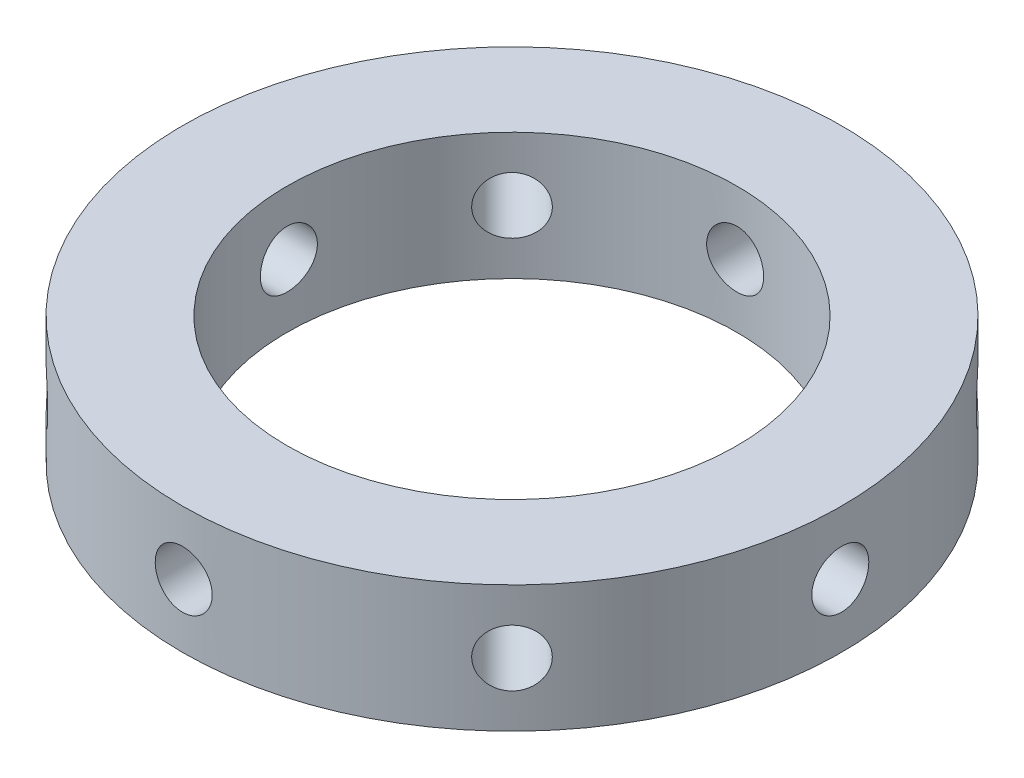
ISO-10303-21;
HEADER;
FILE_DESCRIPTION(('STEP AP214'),'2;1');
FILE_NAME('part.step','',(''),(''),'','','');
FILE_SCHEMA(('AUTOMOTIVE_DESIGN { 1 0 10303 214 1 1 1 1 }'));
ENDSEC;
DATA;
#1=APPLICATION_CONTEXT('core data for automotive mechanical design processes');
#2=APPLICATION_PROTOCOL_DEFINITION('international standard','automotive_design',2000,#1);
#3=PRODUCT_CONTEXT('',#1,'mechanical');
#4=PRODUCT('Part','Part','',(#3));
#5=PRODUCT_RELATED_PRODUCT_CATEGORY('part','',(#4));
#6=PRODUCT_DEFINITION_FORMATION('','',#4);
#7=PRODUCT_DEFINITION_CONTEXT('part definition',#1,'design');
#8=PRODUCT_DEFINITION('design','',#6,#7);
#9=PRODUCT_DEFINITION_SHAPE('','',#8);
#10=(LENGTH_UNIT() NAMED_UNIT(*) SI_UNIT(.MILLI.,.METRE.));
#11=(NAMED_UNIT(*) PLANE_ANGLE_UNIT() SI_UNIT($,.RADIAN.));
#12=(NAMED_UNIT(*) SI_UNIT($,.STERADIAN.) SOLID_ANGLE_UNIT());
#13=UNCERTAINTY_MEASURE_WITH_UNIT(LENGTH_MEASURE(1.E-05),#10,'distance_accuracy_value','');
#14=(GEOMETRIC_REPRESENTATION_CONTEXT(3) GLOBAL_UNCERTAINTY_ASSIGNED_CONTEXT((#13)) GLOBAL_UNIT_ASSIGNED_CONTEXT((#10,
#11,#12)) REPRESENTATION_CONTEXT('',''));
#15=CARTESIAN_POINT('',(0.,0.,0.));
#16=DIRECTION('',(0.,0.,1.));
#17=DIRECTION('',(1.,0.,0.));
#18=AXIS2_PLACEMENT_3D('',#15,#16,#17);
#19=CARTESIAN_POINT('',(0.,10.,0.));
#20=DIRECTION('',(0.,1.,0.));
#21=DIRECTION('',(0.,0.,1.));
#22=AXIS2_PLACEMENT_3D('',#19,#20,#21);
#23=PLANE('',#22);
#24=CARTESIAN_POINT('',(0.,10.,0.));
#25=DIRECTION('',(0.,1.,0.));
#26=DIRECTION('',(0.,0.,1.));
#27=AXIS2_PLACEMENT_3D('',#24,#25,#26);
#28=CIRCLE('',#27,26.);
#29=CARTESIAN_POINT('',(0.,10.,26.));
#30=VERTEX_POINT('',#29);
#31=EDGE_CURVE('E10',#30,#30,#28,.T.);
#32=ORIENTED_EDGE('',*,*,#31,.T.);
#33=EDGE_LOOP('',(#32));
#34=FACE_BOUND('',#33,.T.);
#35=CARTESIAN_POINT('',(0.,10.,0.));
#36=DIRECTION('',(0.,1.,0.));
#37=DIRECTION('',(0.,0.,1.));
#38=AXIS2_PLACEMENT_3D('',#35,#36,#37);
#39=CIRCLE('',#38,17.75);
#40=CARTESIAN_POINT('',(0.,10.,17.75));
#41=VERTEX_POINT('',#40);
#42=EDGE_CURVE('E44',#41,#41,#39,.T.);
#43=ORIENTED_EDGE('',*,*,#42,.F.);
#44=EDGE_LOOP('',(#43));
#45=FACE_BOUND('',#44,.T.);
#46=ADVANCED_FACE('F33',(#34,#45),#23,.T.);
#47=CARTESIAN_POINT('',(0.,0.,0.));
#48=DIRECTION('',(0.,1.,0.));
#49=DIRECTION('',(0.,0.,1.));
#50=AXIS2_PLACEMENT_3D('',#47,#48,#49);
#51=PLANE('',#50);
#52=CARTESIAN_POINT('',(0.,0.,0.));
#53=DIRECTION('',(0.,1.,0.));
#54=DIRECTION('',(0.,0.,1.));
#55=AXIS2_PLACEMENT_3D('',#52,#53,#54);
#56=CIRCLE('',#55,26.);
#57=CARTESIAN_POINT('',(0.,0.,26.));
#58=VERTEX_POINT('',#57);
#59=EDGE_CURVE('E37',#58,#58,#56,.T.);
#60=ORIENTED_EDGE('',*,*,#59,.F.);
#61=EDGE_LOOP('',(#60));
#62=FACE_BOUND('',#61,.T.);
#63=CARTESIAN_POINT('',(0.,0.,0.));
#64=DIRECTION('',(0.,1.,0.));
#65=DIRECTION('',(0.,0.,1.));
#66=AXIS2_PLACEMENT_3D('',#63,#64,#65);
#67=CIRCLE('',#66,17.75);
#68=CARTESIAN_POINT('',(0.,0.,17.75));
#69=VERTEX_POINT('',#68);
#70=EDGE_CURVE('E46',#69,#69,#67,.T.);
#71=ORIENTED_EDGE('',*,*,#70,.T.);
#72=EDGE_LOOP('',(#71));
#73=FACE_BOUND('',#72,.T.);
#74=ADVANCED_FACE('F226',(#62,#73),#51,.F.);
#75=CARTESIAN_POINT('',(0.,10.,0.));
#76=DIRECTION('',(0.,-1.,0.));
#77=DIRECTION('',(0.,0.,-1.));
#78=AXIS2_PLACEMENT_3D('',#75,#76,#77);
#79=CYLINDRICAL_SURFACE('',#78,26.);
#80=CARTESIAN_POINT('',(2.24999999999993,5.,25.9024612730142));
#81=CARTESIAN_POINT('',(2.24999449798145,5.12612935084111,25.9024625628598));
#82=CARTESIAN_POINT('',(2.23935857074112,5.25234412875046,25.9033924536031));
#83=CARTESIAN_POINT('',(2.19708712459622,5.50128021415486,25.9070114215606));
#84=CARTESIAN_POINT('',(2.16542792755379,5.62399741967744,25.9097024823));
#85=CARTESIAN_POINT('',(2.08203354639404,5.86229697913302,25.9165367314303));
#86=CARTESIAN_POINT('',(2.03030988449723,5.97788338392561,25.920679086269));
#87=CARTESIAN_POINT('',(1.90827561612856,6.19870666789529,25.9299481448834));
#88=CARTESIAN_POINT('',(1.83796893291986,6.30394572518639,25.9350746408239));
#89=CARTESIAN_POINT('',(1.68055514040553,6.5014042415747,25.9457502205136));
#90=CARTESIAN_POINT('',(1.59340734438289,6.59359121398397,25.9513003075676));
#91=CARTESIAN_POINT('',(1.40487140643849,6.76204948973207,25.9621885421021));
#92=CARTESIAN_POINT('',(1.30348263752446,6.83832009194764,25.9675266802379));
#93=CARTESIAN_POINT('',(1.08914791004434,6.97288957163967,25.9773991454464));
#94=CARTESIAN_POINT('',(0.976184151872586,7.03116019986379,25.9819322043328));
#95=CARTESIAN_POINT('',(0.742030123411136,7.12789494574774,25.989672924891));
#96=CARTESIAN_POINT('',(0.620840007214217,7.16635943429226,25.9928806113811));
#97=CARTESIAN_POINT('',(0.373997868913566,7.22229613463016,25.9976021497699));
#98=CARTESIAN_POINT('',(0.248357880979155,7.23982108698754,25.9991202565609));
#99=CARTESIAN_POINT('',(-0.00408877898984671,7.25354431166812,26.0003060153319));
#100=CARTESIAN_POINT('',(-0.130895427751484,7.24974300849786,25.9999737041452));
#101=CARTESIAN_POINT('',(-0.38171814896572,7.22096470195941,25.9974995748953));
#102=CARTESIAN_POINT('',(-0.505740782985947,7.19604441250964,25.995362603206));
#103=CARTESIAN_POINT('',(-0.747836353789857,7.12582374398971,25.9895250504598));
#104=CARTESIAN_POINT('',(-0.865909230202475,7.08052315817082,25.9858244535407));
#105=CARTESIAN_POINT('',(-1.09293379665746,6.97076478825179,25.9772675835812));
#106=CARTESIAN_POINT('',(-1.20187317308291,6.90628165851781,25.9724097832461));
#107=CARTESIAN_POINT('',(-1.40740395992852,6.76000704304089,25.9620842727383));
#108=CARTESIAN_POINT('',(-1.50399509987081,6.67821517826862,25.9566165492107));
#109=CARTESIAN_POINT('',(-1.6824192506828,6.49932534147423,25.945664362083));
#110=CARTESIAN_POINT('',(-1.76420285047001,6.40217807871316,25.9401799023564));
#111=CARTESIAN_POINT('',(-1.91030850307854,6.19550671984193,25.9298303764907));
#112=CARTESIAN_POINT('',(-1.97463053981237,6.085982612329,25.9249653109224));
#113=CARTESIAN_POINT('',(-2.08398561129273,5.85763127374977,25.9164046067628));
#114=CARTESIAN_POINT('',(-2.12901599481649,5.73880276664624,25.9127091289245));
#115=CARTESIAN_POINT('',(-2.1984724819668,5.49523267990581,25.9069091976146));
#116=CARTESIAN_POINT('',(-2.22289905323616,5.37049123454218,25.9048047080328));
#117=CARTESIAN_POINT('',(-2.25039180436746,5.11906884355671,25.9024309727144));
#118=CARTESIAN_POINT('',(-2.25352692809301,4.99239549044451,25.9021558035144));
#119=CARTESIAN_POINT('',(-2.23852846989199,4.74032506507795,25.9034562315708));
#120=CARTESIAN_POINT('',(-2.22039510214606,4.61492797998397,25.9050318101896));
#121=CARTESIAN_POINT('',(-2.16343191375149,4.36916812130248,25.9098508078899));
#122=CARTESIAN_POINT('',(-2.12463434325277,4.24879781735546,25.9130916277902));
#123=CARTESIAN_POINT('',(-2.02747688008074,4.01627498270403,25.9208738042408));
#124=CARTESIAN_POINT('',(-1.96911664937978,3.90412259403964,25.9254151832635));
#125=CARTESIAN_POINT('',(-1.8343163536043,3.69090391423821,25.935301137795));
#126=CARTESIAN_POINT('',(-1.75783039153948,3.58986673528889,25.9406477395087));
#127=CARTESIAN_POINT('',(-1.58901598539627,3.40204095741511,25.9515349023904));
#128=CARTESIAN_POINT('',(-1.49668724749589,3.31525262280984,25.957075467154));
#129=CARTESIAN_POINT('',(-1.2985100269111,3.15815237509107,25.9677439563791));
#130=CARTESIAN_POINT('',(-1.19262593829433,3.08788528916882,25.9728707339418));
#131=CARTESIAN_POINT('',(-0.970520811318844,2.96612989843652,25.9821174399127));
#132=CARTESIAN_POINT('',(-0.854299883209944,2.91464139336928,25.9862373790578));
#133=CARTESIAN_POINT('',(-0.614980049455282,2.83198153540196,25.9930009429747));
#134=CARTESIAN_POINT('',(-0.491890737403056,2.80078257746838,25.9956465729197));
#135=CARTESIAN_POINT('',(-0.242196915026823,2.75949723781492,25.9991715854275));
#136=CARTESIAN_POINT('',(-0.115592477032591,2.74941042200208,26.0000510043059));
#137=CARTESIAN_POINT('',(0.137096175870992,2.75064093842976,25.9999445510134));
#138=CARTESIAN_POINT('',(0.263180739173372,2.76188845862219,25.9989647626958));
#139=CARTESIAN_POINT('',(0.511662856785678,2.80532264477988,25.9952620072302));
#140=CARTESIAN_POINT('',(0.634060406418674,2.83750933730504,25.9925390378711));
#141=CARTESIAN_POINT('',(0.871697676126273,2.92189016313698,25.9856553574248));
#142=CARTESIAN_POINT('',(0.986937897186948,2.97408289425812,25.9814947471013));
#143=CARTESIAN_POINT('',(1.20703185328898,3.09698636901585,25.9722009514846));
#144=CARTESIAN_POINT('',(1.31188573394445,3.16769685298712,25.9670677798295));
#145=CARTESIAN_POINT('',(1.50858804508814,3.3258907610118,25.9563848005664));
#146=CARTESIAN_POINT('',(1.60039478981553,3.41342593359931,25.9508337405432));
#147=CARTESIAN_POINT('',(1.76805130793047,3.60268886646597,25.939951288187));
#148=CARTESIAN_POINT('',(1.84389721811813,3.70442005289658,25.9346199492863));
#149=CARTESIAN_POINT('',(1.97759038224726,3.91939969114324,25.9247691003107));
#150=CARTESIAN_POINT('',(2.03540150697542,4.03267066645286,25.9202512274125));
#151=CARTESIAN_POINT('',(2.13110946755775,4.26727452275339,25.912558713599));
#152=CARTESIAN_POINT('',(2.16902912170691,4.38859798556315,25.9093825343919));
#153=CARTESIAN_POINT('',(2.21425586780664,4.59219351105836,25.9055470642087));
#154=CARTESIAN_POINT('',(2.22764201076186,4.67315746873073,25.9043952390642));
#155=CARTESIAN_POINT('',(2.24551585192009,4.83606892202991,25.9028519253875));
#156=CARTESIAN_POINT('',(2.25000357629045,4.91801641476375,25.9024604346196));
#157=CARTESIAN_POINT('',(2.24999999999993,5.,25.9024612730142));
#158=B_SPLINE_CURVE_WITH_KNOTS('',3,(#80,#81,#82,#83,#84,#85,#86,#87,#88,#89,#90,#91,#92,#93,
#94,#95,#96,#97,#98,#99,#100,#101,#102,#103,#104,#105,#106,#107,#108,#109,#110,#111,#112,#113,
#114,#115,#116,#117,#118,#119,#120,#121,#122,#123,#124,#125,#126,#127,#128,#129,#130,#131,#132,
#133,#134,#135,#136,#137,#138,#139,#140,#141,#142,#143,#144,#145,#146,#147,#148,#149,#150,#151,
#152,#153,#154,#155,#156,#157),.UNSPECIFIED.,.T.,.F.,(4,2,2,2,2,2,2,2,2,2,2,2,2,2,2,2,2,2,2,2,2,
2,2,2,2,2,2,2,2,2,2,2,2,2,2,2,2,2,4),(0.,0.378088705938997,0.756603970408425,1.1349021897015,
1.5131206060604,1.89226445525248,2.27142500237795,2.65117761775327,3.03092312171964,
3.40971012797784,3.7884895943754,4.16625508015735,4.54402439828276,4.92229509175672,
5.30057406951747,5.68009294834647,6.05961217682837,6.43918354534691,6.81874629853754,
7.19707940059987,7.57540869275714,7.95314925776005,8.33089635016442,8.70961037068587,
9.08833141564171,9.46806848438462,9.84780150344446,10.2270167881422,10.6062242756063,
10.9841930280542,11.3621622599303,11.740105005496,12.1180424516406,12.4971614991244,
12.8763722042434,13.2563377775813,13.6358665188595,13.8816234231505,14.1273796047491),.UNSPECIFIED.);
#159=CARTESIAN_POINT('',(2.24999999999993,5.,25.9024612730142));
#160=VERTEX_POINT('',#159);
#161=EDGE_CURVE('E156',#160,#160,#158,.T.);
#162=ORIENTED_EDGE('',*,*,#161,.F.);
#163=EDGE_LOOP('',(#162));
#164=FACE_BOUND('',#163,.T.);
#165=CARTESIAN_POINT('',(-16.7248157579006,5.,19.9067962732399));
#166=CARTESIAN_POINT('',(-16.7248205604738,5.12612935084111,19.906793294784));
#167=CARTESIAN_POINT('',(-16.7329988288,5.25234412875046,19.8999300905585));
#168=CARTESIAN_POINT('',(-16.7654482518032,5.50128021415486,19.8725986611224));
#169=CARTESIAN_POINT('',(-16.7897375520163,5.62399741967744,19.8521150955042));
#170=CARTESIAN_POINT('',(-16.8535388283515,5.86229697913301,19.7979789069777));
#171=CARTESIAN_POINT('',(-16.8930420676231,5.97788338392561,19.7643338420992));
#172=CARTESIAN_POINT('',(-16.9858875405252,6.19870666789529,19.6845967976));
#173=CARTESIAN_POINT('',(-17.039226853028,6.30394572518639,19.6385074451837));
#174=CARTESIAN_POINT('',(-17.1580839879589,6.5014042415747,19.5347478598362));
#175=CARTESIAN_POINT('',(-17.223631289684,6.59359121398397,19.4770495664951));
#176=CARTESIAN_POINT('',(-17.3646454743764,6.76204948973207,19.3514336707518));
#177=CARTESIAN_POINT('',(-17.4401127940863,6.83832009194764,19.2835156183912));
#178=CARTESIAN_POINT('',(-17.5986512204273,6.97288957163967,19.1389389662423));
#179=CARTESIAN_POINT('',(-17.681734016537,7.03116019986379,19.0622668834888));
#180=CARTESIAN_POINT('',(-17.8527794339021,7.12789494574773,18.9021684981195));
#181=CARTESIAN_POINT('',(-17.9407419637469,7.16635943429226,18.818742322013));
#182=CARTESIAN_POINT('',(-18.1186243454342,7.22229613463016,18.6475372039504));
#183=CARTESIAN_POINT('',(-18.2085386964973,7.23982108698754,18.5597697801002));
#184=CARTESIAN_POINT('',(-18.3878838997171,7.25354431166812,18.3821014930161));
#185=CARTESIAN_POINT('',(-18.4773147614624,7.24974300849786,18.2922006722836));
#186=CARTESIAN_POINT('',(-18.6529237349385,7.22096470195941,18.1130927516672));
#187=CARTESIAN_POINT('',(-18.7391099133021,7.19604441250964,18.0238844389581));
#188=CARTESIAN_POINT('',(-18.9061695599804,7.12582374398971,17.8485692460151));
#189=CARTESIAN_POINT('',(-18.9870429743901,7.08052315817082,17.7624623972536));
#190=CARTESIAN_POINT('',(-19.1415229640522,6.97076478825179,17.5958811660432));
#191=CARTESIAN_POINT('',(-19.2151197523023,6.90628165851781,17.515414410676));
#192=CARTESIAN_POINT('',(-19.3531507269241,6.76000704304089,17.3627809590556));
#193=CARTESIAN_POINT('',(-19.4175847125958,6.67821517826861,17.2906144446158));
#194=CARTESIAN_POINT('',(-19.5360052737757,6.49932534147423,17.1567051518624));
#195=CARTESIAN_POINT('',(-19.5899569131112,6.40217807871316,17.0949973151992));
#196=CARTESIAN_POINT('',(-19.6859509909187,6.19550671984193,16.9843667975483));
#197=CARTESIAN_POINT('',(-19.7279934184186,6.08598261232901,16.9354441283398));
#198=CARTESIAN_POINT('',(-19.7992657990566,5.85763127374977,16.852065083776));
#199=CARTESIAN_POINT('',(-19.8284939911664,5.73880276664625,16.8176106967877));
#200=CARTESIAN_POINT('',(-19.8735059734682,5.49523267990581,16.7643963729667));
#201=CARTESIAN_POINT('',(-19.8892900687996,5.37049123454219,16.7456360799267));
#202=CARTESIAN_POINT('',(-19.9070518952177,5.11906884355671,16.7245172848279));
#203=CARTESIAN_POINT('',(-19.9090741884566,4.99239549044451,16.7221058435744));
#204=CARTESIAN_POINT('',(-19.8993882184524,4.74032506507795,16.7336308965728));
#205=CARTESIAN_POINT('',(-19.8876800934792,4.61492797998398,16.7475672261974));
#206=CARTESIAN_POINT('',(-19.8508085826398,4.36916812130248,16.7912538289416));
#207=CARTESIAN_POINT('',(-19.8256661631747,4.24879781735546,16.8209794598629));
#208=CARTESIAN_POINT('',(-19.7624682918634,4.01627498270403,16.8951829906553));
#209=CARTESIAN_POINT('',(-19.7244126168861,3.90412259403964,16.9396611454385));
#210=CARTESIAN_POINT('',(-19.636084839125,3.69090391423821,17.041969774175));
#211=CARTESIAN_POINT('',(-19.5857817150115,3.58986673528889,17.0998341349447));
#212=CARTESIAN_POINT('',(-19.4741102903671,3.40204095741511,17.226902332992));
#213=CARTESIAN_POINT('',(-19.4127417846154,3.31525262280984,17.2961063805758));
#214=CARTESIAN_POINT('',(-19.2801530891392,3.15815237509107,17.443782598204));
#215=CARTESIAN_POINT('',(-19.2089069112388,3.08788528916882,17.522279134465));
#216=CARTESIAN_POINT('',(-19.0583932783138,2.96612989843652,17.6858695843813));
#217=CARTESIAN_POINT('',(-18.9791259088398,2.91464139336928,17.7709634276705));
#218=CARTESIAN_POINT('',(-18.81468379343,2.83198153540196,17.9449706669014));
#219=CARTESIAN_POINT('',(-18.7295172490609,2.80078257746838,18.0338786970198));
#220=CARTESIAN_POINT('',(-18.5554496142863,2.75949723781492,18.2129314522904));
#221=CARTESIAN_POINT('',(-18.4665486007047,2.74941042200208,18.3030761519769));
#222=CARTESIAN_POINT('',(-18.2877954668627,2.75064093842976,18.4816787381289));
#223=CARTESIAN_POINT('',(-18.1979474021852,2.76188845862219,18.5701411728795));
#224=CARTESIAN_POINT('',(-18.0196257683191,2.80532264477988,18.7432263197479));
#225=CARTESIAN_POINT('',(-17.9311522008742,2.83750933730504,18.8278490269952));
#226=CARTESIAN_POINT('',(-17.7582497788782,2.92189016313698,18.9910164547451));
#227=CARTESIAN_POINT('',(-17.6738206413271,2.97408289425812,19.0695616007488));
#228=CARTESIAN_POINT('',(-17.5116190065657,3.09698636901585,19.2186198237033));
#229=CARTESIAN_POINT('',(-17.4338464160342,3.16769685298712,19.2891330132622));
#230=CARTESIAN_POINT('',(-17.2872028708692,3.3258907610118,19.4206685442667));
#231=CARTESIAN_POINT('',(-17.2183605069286,3.41342593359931,19.4816605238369));
#232=CARTESIAN_POINT('',(-17.0921143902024,3.60268886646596,19.5925165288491));
#233=CARTESIAN_POINT('',(-17.034713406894,3.70442005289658,19.6423778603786));
#234=CARTESIAN_POINT('',(-16.9332124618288,3.91939969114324,19.7299476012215));
#235=CARTESIAN_POINT('',(-16.8891392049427,4.03267066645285,19.7676316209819));
#236=CARTESIAN_POINT('',(-16.8160240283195,4.26727452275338,19.8298679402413));
#237=CARTESIAN_POINT('',(-16.7869648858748,4.38859798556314,19.8544352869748));
#238=CARTESIAN_POINT('',(-16.7522726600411,4.59219351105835,19.8837033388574));
#239=CARTESIAN_POINT('',(-16.741992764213,4.67315746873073,19.8923543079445));
#240=CARTESIAN_POINT('',(-16.728262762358,4.83606892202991,19.9039017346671));
#241=CARTESIAN_POINT('',(-16.7248126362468,4.91801641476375,19.9067982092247));
#242=CARTESIAN_POINT('',(-16.7248157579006,5.,19.9067962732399));
#243=B_SPLINE_CURVE_WITH_KNOTS('',3,(#165,#166,#167,#168,#169,#170,#171,#172,#173,#174,#175,
#176,#177,#178,#179,#180,#181,#182,#183,#184,#185,#186,#187,#188,#189,#190,#191,#192,#193,#194,
#195,#196,#197,#198,#199,#200,#201,#202,#203,#204,#205,#206,#207,#208,#209,#210,#211,#212,#213,
#214,#215,#216,#217,#218,#219,#220,#221,#222,#223,#224,#225,#226,#227,#228,#229,#230,#231,#232,
#233,#234,#235,#236,#237,#238,#239,#240,#241,#242),.UNSPECIFIED.,.T.,.F.,(4,2,2,2,2,2,2,2,2,2,2,
2,2,2,2,2,2,2,2,2,2,2,2,2,2,2,2,2,2,2,2,2,2,2,2,2,2,2,4),(0.,0.378088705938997,
0.756603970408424,1.1349021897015,1.5131206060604,1.89226445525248,2.27142500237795,
2.65117761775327,3.03092312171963,3.40971012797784,3.7884895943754,4.16625508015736,
4.54402439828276,4.92229509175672,5.30057406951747,5.68009294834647,6.05961217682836,
6.4391835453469,6.81874629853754,7.19707940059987,7.57540869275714,7.95314925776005,
8.33089635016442,8.70961037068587,9.08833141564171,9.46806848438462,9.84780150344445,
10.2270167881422,10.6062242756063,10.9841930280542,11.3621622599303,11.740105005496,
12.1180424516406,12.4971614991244,12.8763722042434,13.2563377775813,13.6358665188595,
13.8816234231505,14.1273796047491),.UNSPECIFIED.);
#244=CARTESIAN_POINT('',(-16.7248157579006,5.,19.9067962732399));
#245=VERTEX_POINT('',#244);
#246=EDGE_CURVE('E135',#245,#245,#243,.T.);
#247=ORIENTED_EDGE('',*,*,#246,.F.);
#248=EDGE_LOOP('',(#247));
#249=FACE_BOUND('',#248,.T.);
#250=CARTESIAN_POINT('',(-25.9024612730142,5.,2.24999999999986));
#251=CARTESIAN_POINT('',(-25.9024625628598,5.12612935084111,2.24999449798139));
#252=CARTESIAN_POINT('',(-25.9033924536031,5.25234412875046,2.23935857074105));
#253=CARTESIAN_POINT('',(-25.9070114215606,5.50128021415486,2.19708712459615));
#254=CARTESIAN_POINT('',(-25.9097024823,5.62399741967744,2.16542792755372));
#255=CARTESIAN_POINT('',(-25.9165367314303,5.86229697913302,2.08203354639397));
#256=CARTESIAN_POINT('',(-25.920679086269,5.97788338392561,2.03030988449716));
#257=CARTESIAN_POINT('',(-25.9299481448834,6.19870666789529,1.9082756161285));
#258=CARTESIAN_POINT('',(-25.9350746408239,6.30394572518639,1.83796893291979));
#259=CARTESIAN_POINT('',(-25.9457502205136,6.5014042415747,1.68055514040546));
#260=CARTESIAN_POINT('',(-25.9513003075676,6.59359121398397,1.59340734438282));
#261=CARTESIAN_POINT('',(-25.9621885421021,6.76204948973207,1.40487140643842));
#262=CARTESIAN_POINT('',(-25.9675266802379,6.83832009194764,1.30348263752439));
#263=CARTESIAN_POINT('',(-25.9773991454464,6.97288957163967,1.08914791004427));
#264=CARTESIAN_POINT('',(-25.9819322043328,7.03116019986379,0.976184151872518));
#265=CARTESIAN_POINT('',(-25.989672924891,7.12789494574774,0.742030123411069));
#266=CARTESIAN_POINT('',(-25.9928806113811,7.16635943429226,0.620840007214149));
#267=CARTESIAN_POINT('',(-25.9976021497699,7.22229613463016,0.373997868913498));
#268=CARTESIAN_POINT('',(-25.9991202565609,7.23982108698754,0.248357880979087));
#269=CARTESIAN_POINT('',(-26.0003060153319,7.25354431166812,-0.00408877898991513));
#270=CARTESIAN_POINT('',(-25.9999737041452,7.24974300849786,-0.130895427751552));
#271=CARTESIAN_POINT('',(-25.9974995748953,7.22096470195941,-0.381718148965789));
#272=CARTESIAN_POINT('',(-25.995362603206,7.19604441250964,-0.505740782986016));
#273=CARTESIAN_POINT('',(-25.9895250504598,7.12582374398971,-0.747836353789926));
#274=CARTESIAN_POINT('',(-25.9858244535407,7.08052315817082,-0.865909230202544));
#275=CARTESIAN_POINT('',(-25.9772675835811,6.97076478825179,-1.09293379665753));
#276=CARTESIAN_POINT('',(-25.9724097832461,6.90628165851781,-1.20187317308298));
#277=CARTESIAN_POINT('',(-25.9620842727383,6.76000704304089,-1.40740395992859));
#278=CARTESIAN_POINT('',(-25.9566165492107,6.67821517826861,-1.50399509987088));
#279=CARTESIAN_POINT('',(-25.945664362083,6.49932534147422,-1.68241925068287));
#280=CARTESIAN_POINT('',(-25.9401799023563,6.40217807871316,-1.76420285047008));
#281=CARTESIAN_POINT('',(-25.9298303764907,6.19550671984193,-1.91030850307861));
#282=CARTESIAN_POINT('',(-25.9249653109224,6.085982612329,-1.97463053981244));
#283=CARTESIAN_POINT('',(-25.9164046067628,5.85763127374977,-2.0839856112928));
#284=CARTESIAN_POINT('',(-25.9127091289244,5.73880276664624,-2.12901599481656));
#285=CARTESIAN_POINT('',(-25.9069091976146,5.49523267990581,-2.19847248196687));
#286=CARTESIAN_POINT('',(-25.9048047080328,5.37049123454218,-2.22289905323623));
#287=CARTESIAN_POINT('',(-25.9024309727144,5.1190688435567,-2.25039180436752));
#288=CARTESIAN_POINT('',(-25.9021558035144,4.99239549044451,-2.25352692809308));
#289=CARTESIAN_POINT('',(-25.9034562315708,4.74032506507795,-2.23852846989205));
#290=CARTESIAN_POINT('',(-25.9050318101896,4.61492797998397,-2.22039510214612));
#291=CARTESIAN_POINT('',(-25.9098508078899,4.36916812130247,-2.16343191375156));
#292=CARTESIAN_POINT('',(-25.9130916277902,4.24879781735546,-2.12463434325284));
#293=CARTESIAN_POINT('',(-25.9208738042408,4.01627498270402,-2.0274768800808));
#294=CARTESIAN_POINT('',(-25.9254151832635,3.90412259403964,-1.96911664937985));
#295=CARTESIAN_POINT('',(-25.935301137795,3.69090391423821,-1.83431635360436));
#296=CARTESIAN_POINT('',(-25.9406477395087,3.58986673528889,-1.75783039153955));
#297=CARTESIAN_POINT('',(-25.9515349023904,3.40204095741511,-1.58901598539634));
#298=CARTESIAN_POINT('',(-25.957075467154,3.31525262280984,-1.49668724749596));
#299=CARTESIAN_POINT('',(-25.9677439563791,3.15815237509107,-1.29851002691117));
#300=CARTESIAN_POINT('',(-25.9728707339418,3.08788528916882,-1.1926259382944));
#301=CARTESIAN_POINT('',(-25.9821174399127,2.96612989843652,-0.970520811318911));
#302=CARTESIAN_POINT('',(-25.9862373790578,2.91464139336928,-0.854299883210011));
#303=CARTESIAN_POINT('',(-25.9930009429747,2.83198153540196,-0.614980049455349));
#304=CARTESIAN_POINT('',(-25.9956465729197,2.80078257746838,-0.491890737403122));
#305=CARTESIAN_POINT('',(-25.9991715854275,2.75949723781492,-0.24219691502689));
#306=CARTESIAN_POINT('',(-26.0000510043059,2.74941042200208,-0.115592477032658));
#307=CARTESIAN_POINT('',(-25.9999445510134,2.75064093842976,0.137096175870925));
#308=CARTESIAN_POINT('',(-25.9989647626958,2.76188845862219,0.263180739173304));
#309=CARTESIAN_POINT('',(-25.9952620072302,2.80532264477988,0.51166285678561));
#310=CARTESIAN_POINT('',(-25.9925390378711,2.83750933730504,0.634060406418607));
#311=CARTESIAN_POINT('',(-25.9856553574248,2.92189016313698,0.871697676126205));
#312=CARTESIAN_POINT('',(-25.9814947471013,2.97408289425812,0.986937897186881));
#313=CARTESIAN_POINT('',(-25.9722009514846,3.09698636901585,1.20703185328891));
#314=CARTESIAN_POINT('',(-25.9670677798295,3.16769685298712,1.31188573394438));
#315=CARTESIAN_POINT('',(-25.9563848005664,3.3258907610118,1.50858804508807));
#316=CARTESIAN_POINT('',(-25.9508337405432,3.41342593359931,1.60039478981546));
#317=CARTESIAN_POINT('',(-25.939951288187,3.60268886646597,1.7680513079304));
#318=CARTESIAN_POINT('',(-25.9346199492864,3.70442005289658,1.84389721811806));
#319=CARTESIAN_POINT('',(-25.9247691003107,3.91939969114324,1.97759038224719));
#320=CARTESIAN_POINT('',(-25.9202512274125,4.03267066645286,2.03540150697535));
#321=CARTESIAN_POINT('',(-25.912558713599,4.26727452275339,2.13110946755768));
#322=CARTESIAN_POINT('',(-25.9093825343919,4.38859798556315,2.16902912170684));
#323=CARTESIAN_POINT('',(-25.9055470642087,4.59219351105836,2.21425586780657));
#324=CARTESIAN_POINT('',(-25.9043952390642,4.67315746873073,2.2276420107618));
#325=CARTESIAN_POINT('',(-25.9028519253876,4.83606892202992,2.24551585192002));
#326=CARTESIAN_POINT('',(-25.9024604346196,4.91801641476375,2.25000357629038));
#327=CARTESIAN_POINT('',(-25.9024612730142,5.,2.24999999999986));
#328=B_SPLINE_CURVE_WITH_KNOTS('',3,(#250,#251,#252,#253,#254,#255,#256,#257,#258,#259,#260,
#261,#262,#263,#264,#265,#266,#267,#268,#269,#270,#271,#272,#273,#274,#275,#276,#277,#278,#279,
#280,#281,#282,#283,#284,#285,#286,#287,#288,#289,#290,#291,#292,#293,#294,#295,#296,#297,#298,
#299,#300,#301,#302,#303,#304,#305,#306,#307,#308,#309,#310,#311,#312,#313,#314,#315,#316,#317,
#318,#319,#320,#321,#322,#323,#324,#325,#326,#327),.UNSPECIFIED.,.T.,.F.,(4,2,2,2,2,2,2,2,2,2,2,
2,2,2,2,2,2,2,2,2,2,2,2,2,2,2,2,2,2,2,2,2,2,2,2,2,2,2,4),(0.,0.378088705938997,
0.756603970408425,1.1349021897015,1.5131206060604,1.89226445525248,2.27142500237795,
2.65117761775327,3.03092312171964,3.40971012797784,3.7884895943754,4.16625508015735,
4.54402439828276,4.92229509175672,5.30057406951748,5.68009294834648,6.05961217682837,
6.43918354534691,6.81874629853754,7.19707940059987,7.57540869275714,7.95314925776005,
8.33089635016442,8.70961037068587,9.08833141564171,9.46806848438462,9.84780150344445,
10.2270167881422,10.6062242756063,10.9841930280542,11.3621622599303,11.740105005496,
12.1180424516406,12.4971614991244,12.8763722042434,13.2563377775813,13.6358665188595,
13.8816234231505,14.1273796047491),.UNSPECIFIED.);
#329=CARTESIAN_POINT('',(-25.9024612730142,5.,2.24999999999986));
#330=VERTEX_POINT('',#329);
#331=EDGE_CURVE('E114',#330,#330,#328,.T.);
#332=ORIENTED_EDGE('',*,*,#331,.F.);
#333=EDGE_LOOP('',(#332));
#334=FACE_BOUND('',#333,.T.);
#335=CARTESIAN_POINT('',(-19.9067962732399,5.,-16.7248157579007));
#336=CARTESIAN_POINT('',(-19.9067932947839,5.12612935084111,-16.7248205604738));
#337=CARTESIAN_POINT('',(-19.8999300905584,5.25234412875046,-16.7329988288));
#338=CARTESIAN_POINT('',(-19.8725986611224,5.50128021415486,-16.7654482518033));
#339=CARTESIAN_POINT('',(-19.8521150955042,5.62399741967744,-16.7897375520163));
#340=CARTESIAN_POINT('',(-19.7979789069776,5.86229697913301,-16.8535388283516));
#341=CARTESIAN_POINT('',(-19.7643338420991,5.97788338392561,-16.8930420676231));
#342=CARTESIAN_POINT('',(-19.6845967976,6.19870666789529,-16.9858875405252));
#343=CARTESIAN_POINT('',(-19.6385074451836,6.30394572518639,-17.0392268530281));
#344=CARTESIAN_POINT('',(-19.5347478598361,6.5014042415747,-17.1580839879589));
#345=CARTESIAN_POINT('',(-19.4770495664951,6.59359121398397,-17.223631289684));
#346=CARTESIAN_POINT('',(-19.3514336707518,6.76204948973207,-17.3646454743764));
#347=CARTESIAN_POINT('',(-19.2835156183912,6.83832009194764,-17.4401127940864));
#348=CARTESIAN_POINT('',(-19.1389389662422,6.97288957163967,-17.5986512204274));
#349=CARTESIAN_POINT('',(-19.0622668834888,7.03116019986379,-17.681734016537));
#350=CARTESIAN_POINT('',(-18.9021684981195,7.12789494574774,-17.8527794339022));
#351=CARTESIAN_POINT('',(-18.8187423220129,7.16635943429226,-17.9407419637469));
#352=CARTESIAN_POINT('',(-18.6475372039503,7.22229613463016,-18.1186243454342));
#353=CARTESIAN_POINT('',(-18.5597697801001,7.23982108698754,-18.2085386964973));
#354=CARTESIAN_POINT('',(-18.382101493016,7.25354431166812,-18.3878838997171));
#355=CARTESIAN_POINT('',(-18.2922006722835,7.24974300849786,-18.4773147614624));
#356=CARTESIAN_POINT('',(-18.1130927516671,7.22096470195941,-18.6529237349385));
#357=CARTESIAN_POINT('',(-18.0238844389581,7.19604441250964,-18.7391099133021));
#358=CARTESIAN_POINT('',(-17.8485692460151,7.12582374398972,-18.9061695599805));
#359=CARTESIAN_POINT('',(-17.7624623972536,7.08052315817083,-18.9870429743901));
#360=CARTESIAN_POINT('',(-17.5958811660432,6.9707647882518,-19.1415229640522));
#361=CARTESIAN_POINT('',(-17.5154144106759,6.90628165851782,-19.2151197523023));
#362=CARTESIAN_POINT('',(-17.3627809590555,6.76000704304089,-19.3531507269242));
#363=CARTESIAN_POINT('',(-17.2906144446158,6.67821517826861,-19.4175847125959));
#364=CARTESIAN_POINT('',(-17.1567051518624,6.49932534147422,-19.5360052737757));
#365=CARTESIAN_POINT('',(-17.0949973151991,6.40217807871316,-19.5899569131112));
#366=CARTESIAN_POINT('',(-16.9843667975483,6.19550671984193,-19.6859509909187));
#367=CARTESIAN_POINT('',(-16.9354441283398,6.08598261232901,-19.7279934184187));
#368=CARTESIAN_POINT('',(-16.8520650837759,5.85763127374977,-19.7992657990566));
#369=CARTESIAN_POINT('',(-16.8176106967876,5.73880276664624,-19.8284939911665));
#370=CARTESIAN_POINT('',(-16.7643963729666,5.49523267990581,-19.8735059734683));
#371=CARTESIAN_POINT('',(-16.7456360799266,5.37049123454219,-19.8892900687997));
#372=CARTESIAN_POINT('',(-16.7245172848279,5.11906884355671,-19.9070518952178));
#373=CARTESIAN_POINT('',(-16.7221058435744,4.99239549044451,-19.9090741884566));
#374=CARTESIAN_POINT('',(-16.7336308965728,4.74032506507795,-19.8993882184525));
#375=CARTESIAN_POINT('',(-16.7475672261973,4.61492797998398,-19.8876800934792));
#376=CARTESIAN_POINT('',(-16.7912538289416,4.36916812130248,-19.8508085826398));
#377=CARTESIAN_POINT('',(-16.8209794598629,4.24879781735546,-19.8256661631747));
#378=CARTESIAN_POINT('',(-16.8951829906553,4.01627498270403,-19.7624682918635));
#379=CARTESIAN_POINT('',(-16.9396611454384,3.90412259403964,-19.7244126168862));
#380=CARTESIAN_POINT('',(-17.041969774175,3.69090391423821,-19.6360848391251));
#381=CARTESIAN_POINT('',(-17.0998341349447,3.58986673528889,-19.5857817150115));
#382=CARTESIAN_POINT('',(-17.226902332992,3.40204095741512,-19.4741102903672));
#383=CARTESIAN_POINT('',(-17.2961063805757,3.31525262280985,-19.4127417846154));
#384=CARTESIAN_POINT('',(-17.443782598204,3.15815237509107,-19.2801530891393));
#385=CARTESIAN_POINT('',(-17.5222791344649,3.08788528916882,-19.2089069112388));
#386=CARTESIAN_POINT('',(-17.6858695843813,2.96612989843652,-19.0583932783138));
#387=CARTESIAN_POINT('',(-17.7709634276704,2.91464139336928,-18.9791259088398));
#388=CARTESIAN_POINT('',(-17.9449706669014,2.83198153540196,-18.8146837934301));
#389=CARTESIAN_POINT('',(-18.0338786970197,2.80078257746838,-18.729517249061));
#390=CARTESIAN_POINT('',(-18.2129314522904,2.75949723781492,-18.5554496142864));
#391=CARTESIAN_POINT('',(-18.3030761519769,2.74941042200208,-18.4665486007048));
#392=CARTESIAN_POINT('',(-18.4816787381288,2.75064093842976,-18.2877954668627));
#393=CARTESIAN_POINT('',(-18.5701411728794,2.76188845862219,-18.1979474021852));
#394=CARTESIAN_POINT('',(-18.7432263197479,2.80532264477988,-18.0196257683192));
#395=CARTESIAN_POINT('',(-18.8278490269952,2.83750933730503,-17.9311522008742));
#396=CARTESIAN_POINT('',(-18.991016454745,2.92189016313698,-17.7582497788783));
#397=CARTESIAN_POINT('',(-19.0695616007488,2.97408289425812,-17.6738206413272));
#398=CARTESIAN_POINT('',(-19.2186198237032,3.09698636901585,-17.5116190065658));
#399=CARTESIAN_POINT('',(-19.2891330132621,3.16769685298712,-17.4338464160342));
#400=CARTESIAN_POINT('',(-19.4206685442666,3.3258907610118,-17.2872028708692));
#401=CARTESIAN_POINT('',(-19.4816605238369,3.41342593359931,-17.2183605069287));
#402=CARTESIAN_POINT('',(-19.5925165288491,3.60268886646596,-17.0921143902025));
#403=CARTESIAN_POINT('',(-19.6423778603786,3.70442005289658,-17.034713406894));
#404=CARTESIAN_POINT('',(-19.7299476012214,3.91939969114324,-16.9332124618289));
#405=CARTESIAN_POINT('',(-19.7676316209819,4.03267066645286,-16.8891392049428));
#406=CARTESIAN_POINT('',(-19.8298679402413,4.26727452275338,-16.8160240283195));
#407=CARTESIAN_POINT('',(-19.8544352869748,4.38859798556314,-16.7869648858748));
#408=CARTESIAN_POINT('',(-19.8837033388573,4.59219351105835,-16.7522726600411));
#409=CARTESIAN_POINT('',(-19.8923543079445,4.67315746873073,-16.7419927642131));
#410=CARTESIAN_POINT('',(-19.9039017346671,4.83606892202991,-16.728262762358));
#411=CARTESIAN_POINT('',(-19.9067982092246,4.91801641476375,-16.7248126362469));
#412=CARTESIAN_POINT('',(-19.9067962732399,5.,-16.7248157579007));
#413=B_SPLINE_CURVE_WITH_KNOTS('',3,(#335,#336,#337,#338,#339,#340,#341,#342,#343,#344,#345,
#346,#347,#348,#349,#350,#351,#352,#353,#354,#355,#356,#357,#358,#359,#360,#361,#362,#363,#364,
#365,#366,#367,#368,#369,#370,#371,#372,#373,#374,#375,#376,#377,#378,#379,#380,#381,#382,#383,
#384,#385,#386,#387,#388,#389,#390,#391,#392,#393,#394,#395,#396,#397,#398,#399,#400,#401,#402,
#403,#404,#405,#406,#407,#408,#409,#410,#411,#412),.UNSPECIFIED.,.T.,.F.,(4,2,2,2,2,2,2,2,2,2,2,
2,2,2,2,2,2,2,2,2,2,2,2,2,2,2,2,2,2,2,2,2,2,2,2,2,2,2,4),(0.,0.378088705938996,
0.756603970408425,1.1349021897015,1.5131206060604,1.89226445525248,2.27142500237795,
2.65117761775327,3.03092312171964,3.40971012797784,3.78848959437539,4.16625508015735,
4.54402439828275,4.92229509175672,5.30057406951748,5.68009294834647,6.05961217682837,
6.43918354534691,6.81874629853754,7.19707940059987,7.57540869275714,7.95314925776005,
8.33089635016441,8.70961037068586,9.0883314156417,9.46806848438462,9.84780150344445,
10.2270167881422,10.6062242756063,10.9841930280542,11.3621622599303,11.740105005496,
12.1180424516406,12.4971614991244,12.8763722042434,13.2563377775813,13.6358665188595,
13.8816234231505,14.1273796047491),.UNSPECIFIED.);
#414=CARTESIAN_POINT('',(-19.9067962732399,5.,-16.7248157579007));
#415=VERTEX_POINT('',#414);
#416=EDGE_CURVE('E104',#415,#415,#413,.T.);
#417=ORIENTED_EDGE('',*,*,#416,.F.);
#418=EDGE_LOOP('',(#417));
#419=FACE_BOUND('',#418,.T.);
#420=CARTESIAN_POINT('',(-2.2499999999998,5.,-25.9024612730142));
#421=CARTESIAN_POINT('',(-2.24999449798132,5.12612935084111,-25.9024625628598));
#422=CARTESIAN_POINT('',(-2.23935857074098,5.25234412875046,-25.9033924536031));
#423=CARTESIAN_POINT('',(-2.19708712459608,5.50128021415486,-25.9070114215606));
#424=CARTESIAN_POINT('',(-2.16542792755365,5.62399741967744,-25.9097024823));
#425=CARTESIAN_POINT('',(-2.0820335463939,5.86229697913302,-25.9165367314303));
#426=CARTESIAN_POINT('',(-2.03030988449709,5.97788338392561,-25.920679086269));
#427=CARTESIAN_POINT('',(-1.90827561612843,6.19870666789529,-25.9299481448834));
#428=CARTESIAN_POINT('',(-1.83796893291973,6.30394572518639,-25.9350746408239));
#429=CARTESIAN_POINT('',(-1.68055514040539,6.5014042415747,-25.9457502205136));
#430=CARTESIAN_POINT('',(-1.59340734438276,6.59359121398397,-25.9513003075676));
#431=CARTESIAN_POINT('',(-1.40487140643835,6.76204948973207,-25.9621885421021));
#432=CARTESIAN_POINT('',(-1.30348263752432,6.83832009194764,-25.9675266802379));
#433=CARTESIAN_POINT('',(-1.0891479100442,6.97288957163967,-25.9773991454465));
#434=CARTESIAN_POINT('',(-0.97618415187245,7.03116019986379,-25.9819322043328));
#435=CARTESIAN_POINT('',(-0.742030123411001,7.12789494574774,-25.989672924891));
#436=CARTESIAN_POINT('',(-0.620840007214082,7.16635943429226,-25.9928806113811));
#437=CARTESIAN_POINT('',(-0.373997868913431,7.22229613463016,-25.9976021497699));
#438=CARTESIAN_POINT('',(-0.248357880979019,7.23982108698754,-25.9991202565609));
#439=CARTESIAN_POINT('',(0.00408877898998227,7.25354431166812,-26.0003060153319));
#440=CARTESIAN_POINT('',(0.130895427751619,7.24974300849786,-25.9999737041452));
#441=CARTESIAN_POINT('',(0.381718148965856,7.22096470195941,-25.9974995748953));
#442=CARTESIAN_POINT('',(0.505740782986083,7.19604441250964,-25.995362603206));
#443=CARTESIAN_POINT('',(0.747836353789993,7.12582374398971,-25.9895250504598));
#444=CARTESIAN_POINT('',(0.865909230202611,7.08052315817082,-25.9858244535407));
#445=CARTESIAN_POINT('',(1.0929337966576,6.97076478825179,-25.9772675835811));
#446=CARTESIAN_POINT('',(1.20187317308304,6.90628165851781,-25.9724097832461));
#447=CARTESIAN_POINT('',(1.40740395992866,6.76000704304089,-25.9620842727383));
#448=CARTESIAN_POINT('',(1.50399509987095,6.67821517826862,-25.9566165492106));
#449=CARTESIAN_POINT('',(1.68241925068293,6.49932534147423,-25.945664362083));
#450=CARTESIAN_POINT('',(1.76420285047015,6.40217807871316,-25.9401799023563));
#451=CARTESIAN_POINT('',(1.91030850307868,6.19550671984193,-25.9298303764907));
#452=CARTESIAN_POINT('',(1.9746305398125,6.085982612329,-25.9249653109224));
#453=CARTESIAN_POINT('',(2.08398561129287,5.85763127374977,-25.9164046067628));
#454=CARTESIAN_POINT('',(2.12901599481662,5.73880276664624,-25.9127091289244));
#455=CARTESIAN_POINT('',(2.19847248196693,5.49523267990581,-25.9069091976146));
#456=CARTESIAN_POINT('',(2.2228990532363,5.37049123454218,-25.9048047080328));
#457=CARTESIAN_POINT('',(2.25039180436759,5.1190688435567,-25.9024309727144));
#458=CARTESIAN_POINT('',(2.25352692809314,4.99239549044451,-25.9021558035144));
#459=CARTESIAN_POINT('',(2.23852846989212,4.74032506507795,-25.9034562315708));
#460=CARTESIAN_POINT('',(2.22039510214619,4.61492797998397,-25.9050318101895));
#461=CARTESIAN_POINT('',(2.16343191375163,4.36916812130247,-25.9098508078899));
#462=CARTESIAN_POINT('',(2.1246343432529,4.24879781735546,-25.9130916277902));
#463=CARTESIAN_POINT('',(2.02747688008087,4.01627498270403,-25.9208738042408));
#464=CARTESIAN_POINT('',(1.96911664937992,3.90412259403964,-25.9254151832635));
#465=CARTESIAN_POINT('',(1.83431635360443,3.69090391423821,-25.935301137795));
#466=CARTESIAN_POINT('',(1.75783039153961,3.58986673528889,-25.9406477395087));
#467=CARTESIAN_POINT('',(1.58901598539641,3.40204095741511,-25.9515349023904));
#468=CARTESIAN_POINT('',(1.49668724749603,3.31525262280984,-25.957075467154));
#469=CARTESIAN_POINT('',(1.29851002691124,3.15815237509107,-25.967743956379));
#470=CARTESIAN_POINT('',(1.19262593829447,3.08788528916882,-25.9728707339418));
#471=CARTESIAN_POINT('',(0.970520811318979,2.96612989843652,-25.9821174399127));
#472=CARTESIAN_POINT('',(0.854299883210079,2.91464139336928,-25.9862373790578));
#473=CARTESIAN_POINT('',(0.614980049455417,2.83198153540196,-25.9930009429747));
#474=CARTESIAN_POINT('',(0.49189073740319,2.80078257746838,-25.9956465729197));
#475=CARTESIAN_POINT('',(0.242196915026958,2.75949723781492,-25.9991715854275));
#476=CARTESIAN_POINT('',(0.115592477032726,2.74941042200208,-26.0000510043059));
#477=CARTESIAN_POINT('',(-0.137096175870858,2.75064093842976,-25.9999445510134));
#478=CARTESIAN_POINT('',(-0.263180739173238,2.76188845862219,-25.9989647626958));
#479=CARTESIAN_POINT('',(-0.511662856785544,2.80532264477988,-25.9952620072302));
#480=CARTESIAN_POINT('',(-0.63406040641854,2.83750933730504,-25.9925390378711));
#481=CARTESIAN_POINT('',(-0.871697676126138,2.92189016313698,-25.9856553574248));
#482=CARTESIAN_POINT('',(-0.986937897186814,2.97408289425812,-25.9814947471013));
#483=CARTESIAN_POINT('',(-1.20703185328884,3.09698636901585,-25.9722009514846));
#484=CARTESIAN_POINT('',(-1.31188573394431,3.16769685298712,-25.9670677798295));
#485=CARTESIAN_POINT('',(-1.508588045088,3.3258907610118,-25.9563848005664));
#486=CARTESIAN_POINT('',(-1.60039478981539,3.41342593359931,-25.9508337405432));
#487=CARTESIAN_POINT('',(-1.76805130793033,3.60268886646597,-25.939951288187));
#488=CARTESIAN_POINT('',(-1.843897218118,3.70442005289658,-25.9346199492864));
#489=CARTESIAN_POINT('',(-1.97759038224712,3.91939969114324,-25.9247691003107));
#490=CARTESIAN_POINT('',(-2.03540150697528,4.03267066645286,-25.9202512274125));
#491=CARTESIAN_POINT('',(-2.13110946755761,4.26727452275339,-25.912558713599));
#492=CARTESIAN_POINT('',(-2.16902912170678,4.38859798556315,-25.9093825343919));
#493=CARTESIAN_POINT('',(-2.2142558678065,4.59219351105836,-25.9055470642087));
#494=CARTESIAN_POINT('',(-2.22764201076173,4.67315746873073,-25.9043952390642));
#495=CARTESIAN_POINT('',(-2.24551585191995,4.83606892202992,-25.9028519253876));
#496=CARTESIAN_POINT('',(-2.25000357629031,4.91801641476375,-25.9024604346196));
#497=CARTESIAN_POINT('',(-2.2499999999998,5.,-25.9024612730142));
#498=B_SPLINE_CURVE_WITH_KNOTS('',3,(#420,#421,#422,#423,#424,#425,#426,#427,#428,#429,#430,
#431,#432,#433,#434,#435,#436,#437,#438,#439,#440,#441,#442,#443,#444,#445,#446,#447,#448,#449,
#450,#451,#452,#453,#454,#455,#456,#457,#458,#459,#460,#461,#462,#463,#464,#465,#466,#467,#468,
#469,#470,#471,#472,#473,#474,#475,#476,#477,#478,#479,#480,#481,#482,#483,#484,#485,#486,#487,
#488,#489,#490,#491,#492,#493,#494,#495,#496,#497),.UNSPECIFIED.,.T.,.F.,(4,2,2,2,2,2,2,2,2,2,2,
2,2,2,2,2,2,2,2,2,2,2,2,2,2,2,2,2,2,2,2,2,2,2,2,2,2,2,4),(0.,0.378088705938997,
0.756603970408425,1.1349021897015,1.5131206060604,1.89226445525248,2.27142500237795,
2.65117761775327,3.03092312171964,3.40971012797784,3.7884895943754,4.16625508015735,
4.54402439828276,4.92229509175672,5.30057406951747,5.68009294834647,6.05961217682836,
6.43918354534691,6.81874629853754,7.19707940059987,7.57540869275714,7.95314925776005,
8.33089635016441,8.70961037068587,9.08833141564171,9.46806848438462,9.84780150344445,
10.2270167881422,10.6062242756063,10.9841930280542,11.3621622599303,11.740105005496,
12.1180424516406,12.4971614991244,12.8763722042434,13.2563377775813,13.6358665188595,
13.8816234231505,14.1273796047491),.UNSPECIFIED.);
#499=CARTESIAN_POINT('',(-2.2499999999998,5.,-25.9024612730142));
#500=VERTEX_POINT('',#499);
#501=EDGE_CURVE('E196',#500,#500,#498,.T.);
#502=ORIENTED_EDGE('',*,*,#501,.F.);
#503=EDGE_LOOP('',(#502));
#504=FACE_BOUND('',#503,.T.);
#505=CARTESIAN_POINT('',(16.7248157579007,5.,-19.9067962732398));
#506=CARTESIAN_POINT('',(16.7248205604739,5.12612935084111,-19.9067932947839));
#507=CARTESIAN_POINT('',(16.7329988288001,5.25234412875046,-19.8999300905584));
#508=CARTESIAN_POINT('',(16.7654482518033,5.50128021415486,-19.8725986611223));
#509=CARTESIAN_POINT('',(16.7897375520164,5.62399741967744,-19.8521150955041));
#510=CARTESIAN_POINT('',(16.8535388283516,5.86229697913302,-19.7979789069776));
#511=CARTESIAN_POINT('',(16.8930420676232,5.97788338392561,-19.7643338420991));
#512=CARTESIAN_POINT('',(16.9858875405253,6.19870666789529,-19.6845967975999));
#513=CARTESIAN_POINT('',(17.0392268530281,6.30394572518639,-19.6385074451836));
#514=CARTESIAN_POINT('',(17.158083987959,6.5014042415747,-19.5347478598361));
#515=CARTESIAN_POINT('',(17.2236312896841,6.59359121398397,-19.477049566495));
#516=CARTESIAN_POINT('',(17.3646454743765,6.76204948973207,-19.3514336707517));
#517=CARTESIAN_POINT('',(17.4401127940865,6.83832009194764,-19.2835156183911));
#518=CARTESIAN_POINT('',(17.5986512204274,6.97288957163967,-19.1389389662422));
#519=CARTESIAN_POINT('',(17.6817340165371,7.03116019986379,-19.0622668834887));
#520=CARTESIAN_POINT('',(17.8527794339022,7.12789494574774,-18.9021684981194));
#521=CARTESIAN_POINT('',(17.940741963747,7.16635943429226,-18.8187423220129));
#522=CARTESIAN_POINT('',(18.1186243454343,7.22229613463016,-18.6475372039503));
#523=CARTESIAN_POINT('',(18.2085386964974,7.23982108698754,-18.5597697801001));
#524=CARTESIAN_POINT('',(18.3878838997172,7.25354431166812,-18.382101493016));
#525=CARTESIAN_POINT('',(18.4773147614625,7.24974300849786,-18.2922006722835));
#526=CARTESIAN_POINT('',(18.6529237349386,7.22096470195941,-18.1130927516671));
#527=CARTESIAN_POINT('',(18.7391099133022,7.19604441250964,-18.023884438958));
#528=CARTESIAN_POINT('',(18.9061695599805,7.12582374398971,-17.848569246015));
#529=CARTESIAN_POINT('',(18.9870429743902,7.08052315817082,-17.7624623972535));
#530=CARTESIAN_POINT('',(19.1415229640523,6.97076478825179,-17.5958811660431));
#531=CARTESIAN_POINT('',(19.2151197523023,6.90628165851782,-17.5154144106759));
#532=CARTESIAN_POINT('',(19.3531507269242,6.76000704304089,-17.3627809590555));
#533=CARTESIAN_POINT('',(19.4175847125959,6.67821517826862,-17.2906144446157));
#534=CARTESIAN_POINT('',(19.5360052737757,6.49932534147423,-17.1567051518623));
#535=CARTESIAN_POINT('',(19.5899569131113,6.40217807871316,-17.0949973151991));
#536=CARTESIAN_POINT('',(19.6859509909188,6.19550671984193,-16.9843667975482));
#537=CARTESIAN_POINT('',(19.7279934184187,6.08598261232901,-16.9354441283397));
#538=CARTESIAN_POINT('',(19.7992657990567,5.85763127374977,-16.8520650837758));
#539=CARTESIAN_POINT('',(19.8284939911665,5.73880276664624,-16.8176106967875));
#540=CARTESIAN_POINT('',(19.8735059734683,5.49523267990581,-16.7643963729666));
#541=CARTESIAN_POINT('',(19.8892900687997,5.37049123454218,-16.7456360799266));
#542=CARTESIAN_POINT('',(19.9070518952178,5.11906884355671,-16.7245172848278));
#543=CARTESIAN_POINT('',(19.9090741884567,4.99239549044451,-16.7221058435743));
#544=CARTESIAN_POINT('',(19.8993882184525,4.74032506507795,-16.7336308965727));
#545=CARTESIAN_POINT('',(19.8876800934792,4.61492797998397,-16.7475672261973));
#546=CARTESIAN_POINT('',(19.8508085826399,4.36916812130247,-16.7912538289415));
#547=CARTESIAN_POINT('',(19.8256661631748,4.24879781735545,-16.8209794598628));
#548=CARTESIAN_POINT('',(19.7624682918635,4.01627498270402,-16.8951829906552));
#549=CARTESIAN_POINT('',(19.7244126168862,3.90412259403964,-16.9396611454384));
#550=CARTESIAN_POINT('',(19.6360848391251,3.69090391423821,-17.0419697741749));
#551=CARTESIAN_POINT('',(19.5857817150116,3.58986673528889,-17.0998341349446));
#552=CARTESIAN_POINT('',(19.4741102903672,3.40204095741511,-17.2269023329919));
#553=CARTESIAN_POINT('',(19.4127417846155,3.31525262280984,-17.2961063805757));
#554=CARTESIAN_POINT('',(19.2801530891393,3.15815237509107,-17.4437825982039));
#555=CARTESIAN_POINT('',(19.2089069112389,3.08788528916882,-17.5222791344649));
#556=CARTESIAN_POINT('',(19.0583932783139,2.96612989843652,-17.6858695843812));
#557=CARTESIAN_POINT('',(18.9791259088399,2.91464139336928,-17.7709634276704));
#558=CARTESIAN_POINT('',(18.8146837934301,2.83198153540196,-17.9449706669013));
#559=CARTESIAN_POINT('',(18.729517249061,2.80078257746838,-18.0338786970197));
#560=CARTESIAN_POINT('',(18.5554496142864,2.75949723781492,-18.2129314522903));
#561=CARTESIAN_POINT('',(18.4665486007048,2.74941042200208,-18.3030761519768));
#562=CARTESIAN_POINT('',(18.2877954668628,2.75064093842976,-18.4816787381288));
#563=CARTESIAN_POINT('',(18.1979474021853,2.76188845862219,-18.5701411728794));
#564=CARTESIAN_POINT('',(18.0196257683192,2.80532264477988,-18.7432263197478));
#565=CARTESIAN_POINT('',(17.9311522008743,2.83750933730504,-18.8278490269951));
#566=CARTESIAN_POINT('',(17.7582497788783,2.92189016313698,-18.991016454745));
#567=CARTESIAN_POINT('',(17.6738206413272,2.97408289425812,-19.0695616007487));
#568=CARTESIAN_POINT('',(17.5116190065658,3.09698636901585,-19.2186198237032));
#569=CARTESIAN_POINT('',(17.4338464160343,3.16769685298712,-19.2891330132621));
#570=CARTESIAN_POINT('',(17.2872028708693,3.3258907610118,-19.4206685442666));
#571=CARTESIAN_POINT('',(17.2183605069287,3.41342593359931,-19.4816605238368));
#572=CARTESIAN_POINT('',(17.0921143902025,3.60268886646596,-19.592516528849));
#573=CARTESIAN_POINT('',(17.0347134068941,3.70442005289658,-19.6423778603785));
#574=CARTESIAN_POINT('',(16.933212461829,3.91939969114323,-19.7299476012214));
#575=CARTESIAN_POINT('',(16.8891392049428,4.03267066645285,-19.7676316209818));
#576=CARTESIAN_POINT('',(16.8160240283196,4.26727452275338,-19.8298679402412));
#577=CARTESIAN_POINT('',(16.7869648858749,4.38859798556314,-19.8544352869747));
#578=CARTESIAN_POINT('',(16.7522726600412,4.59219351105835,-19.8837033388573));
#579=CARTESIAN_POINT('',(16.7419927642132,4.67315746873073,-19.8923543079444));
#580=CARTESIAN_POINT('',(16.7282627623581,4.83606892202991,-19.903901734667));
#581=CARTESIAN_POINT('',(16.7248126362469,4.91801641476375,-19.9067982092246));
#582=CARTESIAN_POINT('',(16.7248157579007,5.,-19.9067962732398));
#583=B_SPLINE_CURVE_WITH_KNOTS('',3,(#505,#506,#507,#508,#509,#510,#511,#512,#513,#514,#515,
#516,#517,#518,#519,#520,#521,#522,#523,#524,#525,#526,#527,#528,#529,#530,#531,#532,#533,#534,
#535,#536,#537,#538,#539,#540,#541,#542,#543,#544,#545,#546,#547,#548,#549,#550,#551,#552,#553,
#554,#555,#556,#557,#558,#559,#560,#561,#562,#563,#564,#565,#566,#567,#568,#569,#570,#571,#572,
#573,#574,#575,#576,#577,#578,#579,#580,#581,#582),.UNSPECIFIED.,.T.,.F.,(4,2,2,2,2,2,2,2,2,2,2,
2,2,2,2,2,2,2,2,2,2,2,2,2,2,2,2,2,2,2,2,2,2,2,2,2,2,2,4),(0.,0.378088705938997,
0.756603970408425,1.1349021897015,1.51312060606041,1.89226445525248,2.27142500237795,
2.65117761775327,3.03092312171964,3.40971012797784,3.7884895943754,4.16625508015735,
4.54402439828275,4.92229509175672,5.30057406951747,5.68009294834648,6.05961217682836,
6.43918354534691,6.81874629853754,7.19707940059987,7.57540869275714,7.95314925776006,
8.33089635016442,8.70961037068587,9.08833141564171,9.46806848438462,9.84780150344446,
10.2270167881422,10.6062242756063,10.9841930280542,11.3621622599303,11.740105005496,
12.1180424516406,12.4971614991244,12.8763722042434,13.2563377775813,13.6358665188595,
13.8816234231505,14.1273796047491),.UNSPECIFIED.);
#584=CARTESIAN_POINT('',(16.7248157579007,5.,-19.9067962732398));
#585=VERTEX_POINT('',#584);
#586=EDGE_CURVE('E186',#585,#585,#583,.T.);
#587=ORIENTED_EDGE('',*,*,#586,.F.);
#588=EDGE_LOOP('',(#587));
#589=FACE_BOUND('',#588,.T.);
#590=CARTESIAN_POINT('',(19.90679627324,5.,16.7248157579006));
#591=CARTESIAN_POINT('',(19.906793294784,5.12612935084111,16.7248205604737));
#592=CARTESIAN_POINT('',(19.8999300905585,5.25234412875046,16.7329988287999));
#593=CARTESIAN_POINT('',(19.8725986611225,5.50128021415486,16.7654482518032));
#594=CARTESIAN_POINT('',(19.8521150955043,5.62399741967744,16.7897375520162));
#595=CARTESIAN_POINT('',(19.7979789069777,5.86229697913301,16.8535388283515));
#596=CARTESIAN_POINT('',(19.7643338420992,5.97788338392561,16.893042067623));
#597=CARTESIAN_POINT('',(19.6845967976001,6.19870666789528,16.9858875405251));
#598=CARTESIAN_POINT('',(19.6385074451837,6.30394572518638,17.039226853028));
#599=CARTESIAN_POINT('',(19.5347478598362,6.5014042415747,17.1580839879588));
#600=CARTESIAN_POINT('',(19.4770495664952,6.59359121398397,17.2236312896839));
#601=CARTESIAN_POINT('',(19.3514336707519,6.76204948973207,17.3646454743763));
#602=CARTESIAN_POINT('',(19.2835156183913,6.83832009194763,17.4401127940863));
#603=CARTESIAN_POINT('',(19.1389389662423,6.97288957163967,17.5986512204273));
#604=CARTESIAN_POINT('',(19.0622668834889,7.03116019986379,17.6817340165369));
#605=CARTESIAN_POINT('',(18.9021684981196,7.12789494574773,17.8527794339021));
#606=CARTESIAN_POINT('',(18.818742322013,7.16635943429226,17.9407419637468));
#607=CARTESIAN_POINT('',(18.6475372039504,7.22229613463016,18.1186243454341));
#608=CARTESIAN_POINT('',(18.5597697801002,7.23982108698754,18.2085386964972));
#609=CARTESIAN_POINT('',(18.3821014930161,7.25354431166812,18.387883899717));
#610=CARTESIAN_POINT('',(18.2922006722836,7.24974300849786,18.4773147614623));
#611=CARTESIAN_POINT('',(18.1130927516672,7.22096470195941,18.6529237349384));
#612=CARTESIAN_POINT('',(18.0238844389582,7.19604441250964,18.739109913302));
#613=CARTESIAN_POINT('',(17.8485692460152,7.12582374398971,18.9061695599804));
#614=CARTESIAN_POINT('',(17.7624623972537,7.08052315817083,18.98704297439));
#615=CARTESIAN_POINT('',(17.5958811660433,6.9707647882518,19.1415229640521));
#616=CARTESIAN_POINT('',(17.515414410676,6.90628165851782,19.2151197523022));
#617=CARTESIAN_POINT('',(17.3627809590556,6.7600070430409,19.3531507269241));
#618=CARTESIAN_POINT('',(17.2906144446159,6.67821517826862,19.4175847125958));
#619=CARTESIAN_POINT('',(17.1567051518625,6.49932534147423,19.5360052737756));
#620=CARTESIAN_POINT('',(17.0949973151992,6.40217807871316,19.5899569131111));
#621=CARTESIAN_POINT('',(16.9843667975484,6.19550671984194,19.6859509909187));
#622=CARTESIAN_POINT('',(16.9354441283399,6.08598261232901,19.7279934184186));
#623=CARTESIAN_POINT('',(16.852065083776,5.85763127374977,19.7992657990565));
#624=CARTESIAN_POINT('',(16.8176106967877,5.73880276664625,19.8284939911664));
#625=CARTESIAN_POINT('',(16.7643963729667,5.49523267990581,19.8735059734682));
#626=CARTESIAN_POINT('',(16.7456360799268,5.37049123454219,19.8892900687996));
#627=CARTESIAN_POINT('',(16.724517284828,5.11906884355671,19.9070518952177));
#628=CARTESIAN_POINT('',(16.7221058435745,4.99239549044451,19.9090741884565));
#629=CARTESIAN_POINT('',(16.7336308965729,4.74032506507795,19.8993882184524));
#630=CARTESIAN_POINT('',(16.7475672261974,4.61492797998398,19.8876800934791));
#631=CARTESIAN_POINT('',(16.7912538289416,4.36916812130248,19.8508085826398));
#632=CARTESIAN_POINT('',(16.820979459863,4.24879781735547,19.8256661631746));
#633=CARTESIAN_POINT('',(16.8951829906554,4.01627498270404,19.7624682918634));
#634=CARTESIAN_POINT('',(16.9396611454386,3.90412259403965,19.7244126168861));
#635=CARTESIAN_POINT('',(17.0419697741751,3.69090391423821,19.636084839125));
#636=CARTESIAN_POINT('',(17.0998341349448,3.58986673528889,19.5857817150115));
#637=CARTESIAN_POINT('',(17.2269023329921,3.40204095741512,19.4741102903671));
#638=CARTESIAN_POINT('',(17.2961063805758,3.31525262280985,19.4127417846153));
#639=CARTESIAN_POINT('',(17.4437825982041,3.15815237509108,19.2801530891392));
#640=CARTESIAN_POINT('',(17.522279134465,3.08788528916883,19.2089069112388));
#641=CARTESIAN_POINT('',(17.6858695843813,2.96612989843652,19.0583932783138));
#642=CARTESIAN_POINT('',(17.7709634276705,2.91464139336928,18.9791259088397));
#643=CARTESIAN_POINT('',(17.9449706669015,2.83198153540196,18.81468379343));
#644=CARTESIAN_POINT('',(18.0338786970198,2.80078257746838,18.7295172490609));
#645=CARTESIAN_POINT('',(18.2129314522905,2.75949723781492,18.5554496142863));
#646=CARTESIAN_POINT('',(18.3030761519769,2.74941042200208,18.4665486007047));
#647=CARTESIAN_POINT('',(18.4816787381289,2.75064093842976,18.2877954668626));
#648=CARTESIAN_POINT('',(18.5701411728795,2.76188845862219,18.1979474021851));
#649=CARTESIAN_POINT('',(18.743226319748,2.80532264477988,18.0196257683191));
#650=CARTESIAN_POINT('',(18.8278490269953,2.83750933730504,17.9311522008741));
#651=CARTESIAN_POINT('',(18.9910164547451,2.92189016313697,17.7582497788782));
#652=CARTESIAN_POINT('',(19.0695616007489,2.97408289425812,17.6738206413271));
#653=CARTESIAN_POINT('',(19.2186198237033,3.09698636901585,17.5116190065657));
#654=CARTESIAN_POINT('',(19.2891330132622,3.16769685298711,17.4338464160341));
#655=CARTESIAN_POINT('',(19.4206685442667,3.32589076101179,17.2872028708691));
#656=CARTESIAN_POINT('',(19.481660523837,3.4134259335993,17.2183605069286));
#657=CARTESIAN_POINT('',(19.5925165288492,3.60268886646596,17.0921143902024));
#658=CARTESIAN_POINT('',(19.6423778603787,3.70442005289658,17.0347134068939));
#659=CARTESIAN_POINT('',(19.7299476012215,3.91939969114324,16.9332124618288));
#660=CARTESIAN_POINT('',(19.767631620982,4.03267066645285,16.8891392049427));
#661=CARTESIAN_POINT('',(19.8298679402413,4.26727452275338,16.8160240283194));
#662=CARTESIAN_POINT('',(19.8544352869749,4.38859798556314,16.7869648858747));
#663=CARTESIAN_POINT('',(19.8837033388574,4.59219351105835,16.752272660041));
#664=CARTESIAN_POINT('',(19.8923543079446,4.67315746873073,16.741992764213));
#665=CARTESIAN_POINT('',(19.9039017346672,4.83606892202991,16.7282627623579));
#666=CARTESIAN_POINT('',(19.9067982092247,4.91801641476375,16.7248126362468));
#667=CARTESIAN_POINT('',(19.90679627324,5.,16.7248157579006));
#668=B_SPLINE_CURVE_WITH_KNOTS('',3,(#590,#591,#592,#593,#594,#595,#596,#597,#598,#599,#600,
#601,#602,#603,#604,#605,#606,#607,#608,#609,#610,#611,#612,#613,#614,#615,#616,#617,#618,#619,
#620,#621,#622,#623,#624,#625,#626,#627,#628,#629,#630,#631,#632,#633,#634,#635,#636,#637,#638,
#639,#640,#641,#642,#643,#644,#645,#646,#647,#648,#649,#650,#651,#652,#653,#654,#655,#656,#657,
#658,#659,#660,#661,#662,#663,#664,#665,#666,#667),.UNSPECIFIED.,.T.,.F.,(4,2,2,2,2,2,2,2,2,2,2,
2,2,2,2,2,2,2,2,2,2,2,2,2,2,2,2,2,2,2,2,2,2,2,2,2,2,2,4),(0.,0.378088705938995,
0.756603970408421,1.1349021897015,1.5131206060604,1.89226445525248,2.27142500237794,
2.65117761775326,3.03092312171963,3.40971012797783,3.7884895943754,4.16625508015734,
4.54402439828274,4.92229509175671,5.30057406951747,5.68009294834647,6.05961217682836,
6.4391835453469,6.81874629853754,7.19707940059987,7.57540869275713,7.95314925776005,
8.33089635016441,8.70961037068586,9.0883314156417,9.46806848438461,9.84780150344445,
10.2270167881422,10.6062242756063,10.9841930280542,11.3621622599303,11.740105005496,
12.1180424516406,12.4971614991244,12.8763722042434,13.2563377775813,13.6358665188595,
13.8816234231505,14.1273796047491),.UNSPECIFIED.);
#669=CARTESIAN_POINT('',(19.90679627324,5.,16.7248157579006));
#670=VERTEX_POINT('',#669);
#671=EDGE_CURVE('E81',#670,#670,#668,.T.);
#672=ORIENTED_EDGE('',*,*,#671,.F.);
#673=EDGE_LOOP('',(#672));
#674=FACE_BOUND('',#673,.T.);
#675=CARTESIAN_POINT('',(25.9024612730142,5.,-2.25));
#676=CARTESIAN_POINT('',(25.9024625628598,5.12612935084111,-2.24999449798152));
#677=CARTESIAN_POINT('',(25.9033924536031,5.25234412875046,-2.23935857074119));
#678=CARTESIAN_POINT('',(25.9070114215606,5.50128021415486,-2.19708712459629));
#679=CARTESIAN_POINT('',(25.9097024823,5.62399741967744,-2.16542792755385));
#680=CARTESIAN_POINT('',(25.9165367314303,5.86229697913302,-2.08203354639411));
#681=CARTESIAN_POINT('',(25.920679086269,5.97788338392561,-2.0303098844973));
#682=CARTESIAN_POINT('',(25.9299481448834,6.19870666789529,-1.90827561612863));
#683=CARTESIAN_POINT('',(25.9350746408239,6.30394572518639,-1.83796893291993));
#684=CARTESIAN_POINT('',(25.9457502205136,6.5014042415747,-1.68055514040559));
#685=CARTESIAN_POINT('',(25.9513003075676,6.59359121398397,-1.59340734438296));
#686=CARTESIAN_POINT('',(25.9621885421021,6.76204948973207,-1.40487140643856));
#687=CARTESIAN_POINT('',(25.9675266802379,6.83832009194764,-1.30348263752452));
#688=CARTESIAN_POINT('',(25.9773991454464,6.97288957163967,-1.08914791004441));
#689=CARTESIAN_POINT('',(25.9819322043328,7.03116019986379,-0.976184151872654));
#690=CARTESIAN_POINT('',(25.989672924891,7.12789494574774,-0.742030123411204));
#691=CARTESIAN_POINT('',(25.9928806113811,7.16635943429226,-0.620840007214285));
#692=CARTESIAN_POINT('',(25.9976021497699,7.22229613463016,-0.373997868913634));
#693=CARTESIAN_POINT('',(25.9991202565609,7.23982108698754,-0.248357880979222));
#694=CARTESIAN_POINT('',(26.0003060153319,7.25354431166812,0.0040887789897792));
#695=CARTESIAN_POINT('',(25.9999737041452,7.24974300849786,0.130895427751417));
#696=CARTESIAN_POINT('',(25.9974995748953,7.22096470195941,0.381718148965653));
#697=CARTESIAN_POINT('',(25.995362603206,7.19604441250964,0.505740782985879));
#698=CARTESIAN_POINT('',(25.9895250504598,7.12582374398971,0.74783635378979));
#699=CARTESIAN_POINT('',(25.9858244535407,7.08052315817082,0.865909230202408));
#700=CARTESIAN_POINT('',(25.9772675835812,6.97076478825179,1.09293379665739));
#701=CARTESIAN_POINT('',(25.9724097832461,6.90628165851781,1.20187317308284));
#702=CARTESIAN_POINT('',(25.9620842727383,6.76000704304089,1.40740395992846));
#703=CARTESIAN_POINT('',(25.9566165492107,6.67821517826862,1.50399509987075));
#704=CARTESIAN_POINT('',(25.945664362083,6.49932534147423,1.68241925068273));
#705=CARTESIAN_POINT('',(25.9401799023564,6.40217807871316,1.76420285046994));
#706=CARTESIAN_POINT('',(25.9298303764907,6.19550671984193,1.91030850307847));
#707=CARTESIAN_POINT('',(25.9249653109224,6.085982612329,1.9746305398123));
#708=CARTESIAN_POINT('',(25.9164046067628,5.85763127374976,2.08398561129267));
#709=CARTESIAN_POINT('',(25.9127091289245,5.73880276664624,2.12901599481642));
#710=CARTESIAN_POINT('',(25.9069091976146,5.49523267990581,2.19847248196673));
#711=CARTESIAN_POINT('',(25.9048047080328,5.37049123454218,2.2228990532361));
#712=CARTESIAN_POINT('',(25.9024309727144,5.1190688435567,2.25039180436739));
#713=CARTESIAN_POINT('',(25.9021558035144,4.99239549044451,2.25352692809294));
#714=CARTESIAN_POINT('',(25.9034562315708,4.74032506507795,2.23852846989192));
#715=CARTESIAN_POINT('',(25.9050318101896,4.61492797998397,2.22039510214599));
#716=CARTESIAN_POINT('',(25.9098508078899,4.36916812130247,2.16343191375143));
#717=CARTESIAN_POINT('',(25.9130916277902,4.24879781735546,2.1246343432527));
#718=CARTESIAN_POINT('',(25.9208738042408,4.01627498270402,2.02747688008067));
#719=CARTESIAN_POINT('',(25.9254151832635,3.90412259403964,1.96911664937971));
#720=CARTESIAN_POINT('',(25.935301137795,3.69090391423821,1.83431635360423));
#721=CARTESIAN_POINT('',(25.9406477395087,3.58986673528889,1.75783039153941));
#722=CARTESIAN_POINT('',(25.9515349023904,3.40204095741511,1.58901598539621));
#723=CARTESIAN_POINT('',(25.957075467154,3.31525262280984,1.49668724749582));
#724=CARTESIAN_POINT('',(25.9677439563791,3.15815237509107,1.29851002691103));
#725=CARTESIAN_POINT('',(25.9728707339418,3.08788528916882,1.19262593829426));
#726=CARTESIAN_POINT('',(25.9821174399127,2.96612989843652,0.970520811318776));
#727=CARTESIAN_POINT('',(25.9862373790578,2.91464139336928,0.854299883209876));
#728=CARTESIAN_POINT('',(25.9930009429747,2.83198153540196,0.614980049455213));
#729=CARTESIAN_POINT('',(25.9956465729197,2.80078257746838,0.491890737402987));
#730=CARTESIAN_POINT('',(25.9991715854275,2.75949723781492,0.242196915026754));
#731=CARTESIAN_POINT('',(26.0000510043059,2.74941042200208,0.115592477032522));
#732=CARTESIAN_POINT('',(25.9999445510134,2.75064093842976,-0.137096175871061));
#733=CARTESIAN_POINT('',(25.9989647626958,2.76188845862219,-0.263180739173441));
#734=CARTESIAN_POINT('',(25.9952620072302,2.80532264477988,-0.511662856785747));
#735=CARTESIAN_POINT('',(25.9925390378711,2.83750933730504,-0.634060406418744));
#736=CARTESIAN_POINT('',(25.9856553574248,2.92189016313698,-0.871697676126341));
#737=CARTESIAN_POINT('',(25.9814947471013,2.97408289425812,-0.986937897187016));
#738=CARTESIAN_POINT('',(25.9722009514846,3.09698636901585,-1.20703185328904));
#739=CARTESIAN_POINT('',(25.9670677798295,3.16769685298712,-1.31188573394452));
#740=CARTESIAN_POINT('',(25.9563848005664,3.3258907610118,-1.5085880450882));
#741=CARTESIAN_POINT('',(25.9508337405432,3.41342593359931,-1.6003947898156));
#742=CARTESIAN_POINT('',(25.939951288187,3.60268886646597,-1.76805130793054));
#743=CARTESIAN_POINT('',(25.9346199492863,3.70442005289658,-1.8438972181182));
#744=CARTESIAN_POINT('',(25.9247691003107,3.91939969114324,-1.97759038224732));
#745=CARTESIAN_POINT('',(25.9202512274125,4.03267066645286,-2.03540150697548));
#746=CARTESIAN_POINT('',(25.912558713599,4.26727452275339,-2.13110946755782));
#747=CARTESIAN_POINT('',(25.9093825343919,4.38859798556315,-2.16902912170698));
#748=CARTESIAN_POINT('',(25.9055470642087,4.59219351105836,-2.2142558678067));
#749=CARTESIAN_POINT('',(25.9043952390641,4.67315746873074,-2.22764201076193));
#750=CARTESIAN_POINT('',(25.9028519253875,4.83606892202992,-2.24551585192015));
#751=CARTESIAN_POINT('',(25.9024604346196,4.91801641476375,-2.25000357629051));
#752=CARTESIAN_POINT('',(25.9024612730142,5.,-2.25));
#753=B_SPLINE_CURVE_WITH_KNOTS('',3,(#675,#676,#677,#678,#679,#680,#681,#682,#683,#684,#685,
#686,#687,#688,#689,#690,#691,#692,#693,#694,#695,#696,#697,#698,#699,#700,#701,#702,#703,#704,
#705,#706,#707,#708,#709,#710,#711,#712,#713,#714,#715,#716,#717,#718,#719,#720,#721,#722,#723,
#724,#725,#726,#727,#728,#729,#730,#731,#732,#733,#734,#735,#736,#737,#738,#739,#740,#741,#742,
#743,#744,#745,#746,#747,#748,#749,#750,#751,#752),.UNSPECIFIED.,.T.,.F.,(4,2,2,2,2,2,2,2,2,2,2,
2,2,2,2,2,2,2,2,2,2,2,2,2,2,2,2,2,2,2,2,2,2,2,2,2,2,2,4),(0.,0.378088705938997,
0.756603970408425,1.1349021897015,1.5131206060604,1.89226445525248,2.27142500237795,
2.65117761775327,3.03092312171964,3.40971012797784,3.7884895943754,4.16625508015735,
4.54402439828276,4.92229509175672,5.30057406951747,5.68009294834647,6.05961217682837,
6.43918354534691,6.81874629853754,7.19707940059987,7.57540869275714,7.95314925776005,
8.33089635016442,8.70961037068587,9.08833141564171,9.46806848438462,9.84780150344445,
10.2270167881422,10.6062242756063,10.9841930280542,11.3621622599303,11.740105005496,
12.1180424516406,12.4971614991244,12.8763722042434,13.2563377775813,13.6358665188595,
13.8816234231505,14.1273796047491),.UNSPECIFIED.);
#754=CARTESIAN_POINT('',(25.9024612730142,5.,-2.25));
#755=VERTEX_POINT('',#754);
#756=EDGE_CURVE('E59',#755,#755,#753,.T.);
#757=ORIENTED_EDGE('',*,*,#756,.F.);
#758=EDGE_LOOP('',(#757));
#759=FACE_BOUND('',#758,.T.);
#760=ORIENTED_EDGE('',*,*,#31,.F.);
#761=EDGE_LOOP('',(#760));
#762=FACE_BOUND('',#761,.T.);
#763=ORIENTED_EDGE('',*,*,#59,.T.);
#764=EDGE_LOOP('',(#763));
#765=FACE_BOUND('',#764,.T.);
#766=ADVANCED_FACE('F35',(#164,#249,#334,#419,#504,#589,#674,#759,#762,#765),#79,.T.);
#767=CARTESIAN_POINT('',(0.,10.,0.));
#768=DIRECTION('',(0.,-1.,0.));
#769=DIRECTION('',(0.,0.,-1.));
#770=AXIS2_PLACEMENT_3D('',#767,#768,#769);
#771=CYLINDRICAL_SURFACE('',#770,17.75);
#772=CARTESIAN_POINT('',(2.24999999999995,5.,17.606816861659));
#773=CARTESIAN_POINT('',(2.24999465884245,5.12583756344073,17.6068186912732));
#774=CARTESIAN_POINT('',(2.23940764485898,5.25175341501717,17.6081804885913));
#775=CARTESIAN_POINT('',(2.19734193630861,5.50007981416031,17.6134783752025));
#776=CARTESIAN_POINT('',(2.16584150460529,5.62248657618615,17.6174171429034));
#777=CARTESIAN_POINT('',(2.08289344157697,5.86016354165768,17.6274158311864));
#778=CARTESIAN_POINT('',(2.03145946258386,5.97543856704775,17.6334742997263));
#779=CARTESIAN_POINT('',(1.91013374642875,6.19570006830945,17.6470280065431));
#780=CARTESIAN_POINT('',(1.84024512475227,6.30068827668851,17.654523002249));
#781=CARTESIAN_POINT('',(1.68356351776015,6.49802090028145,17.6701535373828));
#782=CARTESIAN_POINT('',(1.59668553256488,6.59029758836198,17.6782921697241));
#783=CARTESIAN_POINT('',(1.40867436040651,6.75900262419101,17.6942651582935));
#784=CARTESIAN_POINT('',(1.30754046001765,6.83543017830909,17.7020994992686));
#785=CARTESIAN_POINT('',(1.0934620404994,6.9705108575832,17.7166128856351));
#786=CARTESIAN_POINT('',(0.980478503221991,7.02910261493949,17.7232879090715));
#787=CARTESIAN_POINT('',(0.746176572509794,7.12645538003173,17.7346965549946));
#788=CARTESIAN_POINT('',(0.624858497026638,7.1652171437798,17.7394302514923));
#789=CARTESIAN_POINT('',(0.378024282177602,7.22160706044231,17.7464010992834));
#790=CARTESIAN_POINT('',(0.252534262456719,7.23934787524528,17.7486515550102));
#791=CARTESIAN_POINT('',(0.000339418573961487,7.25354149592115,17.7504477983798));
#792=CARTESIAN_POINT('',(-0.126365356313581,7.24999516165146,17.7499936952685));
#793=CARTESIAN_POINT('',(-0.376626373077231,7.22180535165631,17.7464427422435));
#794=CARTESIAN_POINT('',(-0.500196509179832,7.19728304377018,17.743361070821));
#795=CARTESIAN_POINT('',(-0.741453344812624,7.12802684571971,17.7349182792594));
#796=CARTESIAN_POINT('',(-0.859139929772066,7.08329256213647,17.729557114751));
#797=CARTESIAN_POINT('',(-1.08566354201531,6.97475371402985,17.7171315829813));
#798=CARTESIAN_POINT('',(-1.19447522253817,6.91089680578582,17.7100625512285));
#799=CARTESIAN_POINT('',(-1.39988377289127,6.76596345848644,17.6950119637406));
#800=CARTESIAN_POINT('',(-1.49648006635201,6.68488620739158,17.6870303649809));
#801=CARTESIAN_POINT('',(-1.67542783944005,6.50713525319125,17.6709814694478));
#802=CARTESIAN_POINT('',(-1.75767443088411,6.41035593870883,17.6629139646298));
#803=CARTESIAN_POINT('',(-1.90477268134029,6.20431060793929,17.6476578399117));
#804=CARTESIAN_POINT('',(-1.96962428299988,6.09504455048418,17.6404692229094));
#805=CARTESIAN_POINT('',(-2.08009818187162,5.8670329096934,17.6277848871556));
#806=CARTESIAN_POINT('',(-2.1257119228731,5.74828313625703,17.6222899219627));
#807=CARTESIAN_POINT('',(-2.19632146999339,5.50472418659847,17.6136296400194));
#808=CARTESIAN_POINT('',(-2.22131829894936,5.3799153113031,17.6104642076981));
#809=CARTESIAN_POINT('',(-2.24984522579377,5.12870783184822,17.606842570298));
#810=CARTESIAN_POINT('',(-2.25352300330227,5.0023262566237,17.6063677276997));
#811=CARTESIAN_POINT('',(-2.23969722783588,4.75074874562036,17.6081317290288));
#812=CARTESIAN_POINT('',(-2.22219413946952,4.62555278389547,17.6103705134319));
#813=CARTESIAN_POINT('',(-2.16662788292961,4.38034388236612,17.617292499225));
#814=CARTESIAN_POINT('',(-2.12863635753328,4.26031444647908,17.6219671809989));
#815=CARTESIAN_POINT('',(-2.03324546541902,4.02832945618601,17.6332273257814));
#816=CARTESIAN_POINT('',(-1.97584539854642,3.91637419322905,17.6398128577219));
#817=CARTESIAN_POINT('',(-1.84290423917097,3.7030477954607,17.6541972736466));
#818=CARTESIAN_POINT('',(-1.76726638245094,3.60173740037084,17.6620025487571));
#819=CARTESIAN_POINT('',(-1.60013336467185,3.4131966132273,17.6779269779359));
#820=CARTESIAN_POINT('',(-1.50863756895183,3.32596678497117,17.6860461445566));
#821=CARTESIAN_POINT('',(-1.31174043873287,3.16754374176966,17.7017408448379));
#822=CARTESIAN_POINT('',(-1.20626066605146,3.09644762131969,17.7093129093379));
#823=CARTESIAN_POINT('',(-0.984770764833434,2.97298228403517,17.7230082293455));
#824=CARTESIAN_POINT('',(-0.868760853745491,2.92061268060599,17.729131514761));
#825=CARTESIAN_POINT('',(-0.629825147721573,2.83624695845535,17.7392239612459));
#826=CARTESIAN_POINT('',(-0.506919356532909,2.80419492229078,17.7431990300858));
#827=CARTESIAN_POINT('',(-0.257416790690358,2.76119232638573,17.748571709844));
#828=CARTESIAN_POINT('',(-0.130820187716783,2.75024078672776,17.749969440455));
#829=CARTESIAN_POINT('',(0.121522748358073,2.74976873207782,17.7500293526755));
#830=CARTESIAN_POINT('',(0.247268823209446,2.7600985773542,17.7487106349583));
#831=CARTESIAN_POINT('',(0.495222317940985,2.80157888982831,17.7435238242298));
#832=CARTESIAN_POINT('',(0.617429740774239,2.83272933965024,17.7396557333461));
#833=CARTESIAN_POINT('',(0.854815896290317,2.91491921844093,17.7298028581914));
#834=CARTESIAN_POINT('',(0.969997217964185,2.96595126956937,17.7238188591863));
#835=CARTESIAN_POINT('',(1.19018496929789,3.08644022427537,17.7103964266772));
#836=CARTESIAN_POINT('',(1.29519126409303,3.15589737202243,17.7029579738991));
#837=CARTESIAN_POINT('',(1.49281239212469,3.31181776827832,17.6873943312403));
#838=CARTESIAN_POINT('',(1.58533907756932,3.39839231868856,17.6792648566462));
#839=CARTESIAN_POINT('',(1.75460951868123,3.58585845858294,17.6632696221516));
#840=CARTESIAN_POINT('',(1.83134953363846,3.68675343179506,17.6554039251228));
#841=CARTESIAN_POINT('',(1.96712986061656,3.90045677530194,17.6407935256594));
#842=CARTESIAN_POINT('',(2.02609869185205,4.01331085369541,17.6340533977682));
#843=CARTESIAN_POINT('',(2.12416335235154,4.24734299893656,17.6225108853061));
#844=CARTESIAN_POINT('',(2.16328073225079,4.3685118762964,17.617706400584));
#845=CARTESIAN_POINT('',(2.21119829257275,4.57525231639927,17.6117420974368));
#846=CARTESIAN_POINT('',(2.22572792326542,4.65952143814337,17.6099043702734));
#847=CARTESIAN_POINT('',(2.24513055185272,4.82918168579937,17.6074411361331));
#848=CARTESIAN_POINT('',(2.2500036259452,4.91457280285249,17.606815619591));
#849=CARTESIAN_POINT('',(2.24999999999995,5.,17.606816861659));
#850=B_SPLINE_CURVE_WITH_KNOTS('',3,(#772,#773,#774,#775,#776,#777,#778,#779,#780,#781,#782,
#783,#784,#785,#786,#787,#788,#789,#790,#791,#792,#793,#794,#795,#796,#797,#798,#799,#800,#801,
#802,#803,#804,#805,#806,#807,#808,#809,#810,#811,#812,#813,#814,#815,#816,#817,#818,#819,#820,
#821,#822,#823,#824,#825,#826,#827,#828,#829,#830,#831,#832,#833,#834,#835,#836,#837,#838,#839,
#840,#841,#842,#843,#844,#845,#846,#847,#848,#849),.UNSPECIFIED.,.T.,.F.,(4,2,2,2,2,2,2,2,2,2,2,
2,2,2,2,2,2,2,2,2,2,2,2,2,2,2,2,2,2,2,2,2,2,2,2,2,2,2,4),(0.,0.377200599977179,
0.754793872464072,1.13212898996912,1.5094004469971,1.88861009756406,2.26783873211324,
2.64835780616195,3.02886237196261,3.40731826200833,3.78575886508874,4.1620280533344,
4.53830456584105,4.91562061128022,5.29295445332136,5.67294030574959,6.05292741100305,
6.43308334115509,6.81322041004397,7.19072104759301,7.56821340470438,7.94439424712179,
8.32058866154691,8.69882475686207,9.07707599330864,9.4575465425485,9.838009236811,
10.2174202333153,10.5968136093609,10.9735483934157,11.3502828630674,11.7268776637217,
12.1034774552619,12.4826116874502,12.8618356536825,13.2425652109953,13.6228805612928,
13.8789523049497,14.1350220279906),.UNSPECIFIED.);
#851=CARTESIAN_POINT('',(2.24999999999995,5.,17.606816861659));
#852=VERTEX_POINT('',#851);
#853=EDGE_CURVE('E171',#852,#852,#850,.T.);
#854=ORIENTED_EDGE('',*,*,#853,.T.);
#855=EDGE_LOOP('',(#854));
#856=FACE_BOUND('',#855,.T.);
#857=CARTESIAN_POINT('',(-10.8589093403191,5.,14.0408898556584));
#858=CARTESIAN_POINT('',(-10.8589144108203,5.12583756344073,14.0408873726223));
#859=CARTESIAN_POINT('',(-10.8673634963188,5.25175341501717,14.0343641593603));
#860=CARTESIAN_POINT('',(-10.9008546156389,5.50007981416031,14.0083653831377));
#861=CARTESIAN_POINT('',(-10.9259139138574,5.62248657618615,13.9888763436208));
#862=CARTESIAN_POINT('',(-10.9916371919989,5.86016354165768,13.937293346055));
#863=CARTESIAN_POINT('',(-11.0322904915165,5.97543856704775,13.9052080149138));
#864=CARTESIAN_POINT('',(-11.1276646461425,6.19570006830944,13.8290016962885));
#865=CARTESIAN_POINT('',(-11.1823831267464,6.30068827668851,13.784882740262));
#866=CARTESIAN_POINT('',(-11.3042262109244,6.49802090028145,13.6851445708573));
#867=CARTESIAN_POINT('',(-11.3714131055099,6.59029758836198,13.629467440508));
#868=CARTESIAN_POINT('',(-11.5156516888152,6.75900262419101,13.5078180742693));
#869=CARTESIAN_POINT('',(-11.5927038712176,6.8354301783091,13.441845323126));
#870=CARTESIAN_POINT('',(-11.7543426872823,6.97051085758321,13.3007315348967));
#871=CARTESIAN_POINT('',(-11.8389540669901,7.02910261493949,13.2255600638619));
#872=CARTESIAN_POINT('',(-12.0126976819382,7.12645538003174,13.0679507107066));
#873=CARTESIAN_POINT('',(-12.1018297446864,7.1652171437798,12.9855131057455));
#874=CARTESIAN_POINT('',(-12.2812970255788,7.22160706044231,12.8159040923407));
#875=CARTESIAN_POINT('',(-12.3716231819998,7.23934787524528,12.72876056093));
#876=CARTESIAN_POINT('',(-12.5512220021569,7.25354149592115,12.5517020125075));
#877=CARTESIAN_POINT('',(-12.6404947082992,7.24999516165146,12.4617871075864));
#878=CARTESIAN_POINT('',(-12.8149450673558,7.22180535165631,12.2823149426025));
#879=CARTESIAN_POINT('',(-12.9001432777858,7.19728304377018,12.192758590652));
#880=CARTESIAN_POINT('',(-13.0647676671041,7.12802684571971,12.0161942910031));
#881=CARTESIAN_POINT('',(-13.1441937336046,7.08329256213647,11.9291863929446));
#882=CARTESIAN_POINT('',(-13.2955839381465,6.97475371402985,11.7602238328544));
#883=CARTESIAN_POINT('',(-13.3675268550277,6.91089680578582,11.6782837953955));
#884=CARTESIAN_POINT('',(-13.5021302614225,6.76596345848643,11.5223956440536));
#885=CARTESIAN_POINT('',(-13.5647903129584,6.68488620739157,11.4484479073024));
#886=CARTESIAN_POINT('',(-13.6799772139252,6.50713525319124,11.3105644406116));
#887=CARTESIAN_POINT('',(-13.7324297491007,6.41035593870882,11.2467027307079));
#888=CARTESIAN_POINT('',(-13.8256562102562,6.20431060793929,11.1319008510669));
#889=CARTESIAN_POINT('',(-13.8664300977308,6.09504455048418,11.0809607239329));
#890=CARTESIAN_POINT('',(-13.9355777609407,5.86703290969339,10.9938747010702));
#891=CARTESIAN_POINT('',(-13.9639460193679,5.74828313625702,10.9577353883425));
#892=CARTESIAN_POINT('',(-14.007750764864,5.50472418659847,10.9016831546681));
#893=CARTESIAN_POINT('',(-14.0231878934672,5.3799153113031,10.8817694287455));
#894=CARTESIAN_POINT('',(-14.0407985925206,5.12870783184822,10.8590369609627));
#895=CARTESIAN_POINT('',(-14.0430634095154,5.0023262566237,10.8561006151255));
#896=CARTESIAN_POINT('',(-14.0345344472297,4.75074874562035,10.8671242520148));
#897=CARTESIAN_POINT('',(-14.0237409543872,4.62555278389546,10.8810838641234));
#898=CARTESIAN_POINT('',(-13.9893442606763,4.38034388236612,10.9252697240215));
#899=CARTESIAN_POINT('',(-13.9657856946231,4.26031444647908,10.955439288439));
#900=CARTESIAN_POINT('',(-13.9062962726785,4.02832945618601,11.0308529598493));
#901=CARTESIAN_POINT('',(-13.8703649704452,3.91637419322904,11.0760976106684));
#902=CARTESIAN_POINT('',(-13.7865326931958,3.7030477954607,11.1802725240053));
#903=CARTESIAN_POINT('',(-13.7385678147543,3.60173740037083,11.2392757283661));
#904=CARTESIAN_POINT('',(-13.6316471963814,3.41319661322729,11.3687168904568));
#905=CARTESIAN_POINT('',(-13.5726910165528,3.32596678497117,11.4391553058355));
#906=CARTESIAN_POINT('',(-13.4445615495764,3.16754374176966,11.5894804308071));
#907=CARTESIAN_POINT('',(-13.3753303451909,3.09644762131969,11.6694201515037));
#908=CARTESIAN_POINT('',(-13.2283973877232,2.97298228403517,11.8357212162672));
#909=CARTESIAN_POINT('',(-13.1506958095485,2.92061268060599,11.9220824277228));
#910=CARTESIAN_POINT('',(-12.9888791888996,2.83624695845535,12.0981719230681));
#911=CARTESIAN_POINT('',(-12.9047824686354,2.80419492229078,12.1878902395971));
#912=CARTESIAN_POINT('',(-12.7321565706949,2.76119232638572,12.368114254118));
#913=CARTESIAN_POINT('',(-12.6436275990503,2.75024078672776,12.458619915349));
#914=CARTESIAN_POINT('',(-12.4652365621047,2.74976873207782,12.6370956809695));
#915=CARTESIAN_POINT('',(-12.3753881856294,2.7600985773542,12.7250791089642));
#916=CARTESIAN_POINT('',(-12.196390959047,2.80157888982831,12.8967410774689));
#917=CARTESIAN_POINT('',(-12.1072421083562,2.83272933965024,12.9804196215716));
#918=CARTESIAN_POINT('',(-11.9324177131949,2.91491921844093,13.1413099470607));
#919=CARTESIAN_POINT('',(-11.8467408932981,2.96595126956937,13.2185241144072));
#920=CARTESIAN_POINT('',(-11.6815535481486,3.08644022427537,13.3647292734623));
#921=CARTESIAN_POINT('',(-11.6020431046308,3.15589737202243,13.4337201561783));
#922=CARTESIAN_POINT('',(-11.4512987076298,3.31181776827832,13.5624542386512));
#923=CARTESIAN_POINT('',(-11.3801240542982,3.39839231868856,13.6221320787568));
#924=CARTESIAN_POINT('',(-11.2491214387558,3.58585845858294,13.7305140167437));
#925=CARTESIAN_POINT('',(-11.1892961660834,3.68675343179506,13.7792155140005));
#926=CARTESIAN_POINT('',(-11.082953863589,3.90045677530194,13.864895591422));
#927=CARTESIAN_POINT('',(-11.0364906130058,4.01331085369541,13.9018268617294));
#928=CARTESIAN_POINT('',(-10.958986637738,4.24734299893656,13.9630072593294));
#929=CARTESIAN_POINT('',(-10.9279291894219,4.3685118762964,13.9872701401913));
#930=CARTESIAN_POINT('',(-10.8898289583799,4.57525231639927,14.0169355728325));
#931=CARTESIAN_POINT('',(-10.8782554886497,4.65952143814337,14.0259101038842));
#932=CARTESIAN_POINT('',(-10.8627939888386,4.82918168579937,14.0378880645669));
#933=CARTESIAN_POINT('',(-10.8589058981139,4.91457280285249,14.0408915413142));
#934=CARTESIAN_POINT('',(-10.8589093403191,5.,14.0408898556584));
#935=B_SPLINE_CURVE_WITH_KNOTS('',3,(#857,#858,#859,#860,#861,#862,#863,#864,#865,#866,#867,
#868,#869,#870,#871,#872,#873,#874,#875,#876,#877,#878,#879,#880,#881,#882,#883,#884,#885,#886,
#887,#888,#889,#890,#891,#892,#893,#894,#895,#896,#897,#898,#899,#900,#901,#902,#903,#904,#905,
#906,#907,#908,#909,#910,#911,#912,#913,#914,#915,#916,#917,#918,#919,#920,#921,#922,#923,#924,
#925,#926,#927,#928,#929,#930,#931,#932,#933,#934),.UNSPECIFIED.,.T.,.F.,(4,2,2,2,2,2,2,2,2,2,2,
2,2,2,2,2,2,2,2,2,2,2,2,2,2,2,2,2,2,2,2,2,2,2,2,2,2,2,4),(0.,0.37720059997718,0.754793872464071,
1.13212898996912,1.5094004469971,1.88861009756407,2.26783873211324,2.64835780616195,
3.02886237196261,3.40731826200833,3.78575886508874,4.1620280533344,4.53830456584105,
4.91562061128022,5.29295445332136,5.67294030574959,6.05292741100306,6.4330833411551,
6.81322041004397,7.19072104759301,7.56821340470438,7.94439424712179,8.32058866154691,
8.69882475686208,9.07707599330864,9.4575465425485,9.838009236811,10.2174202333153,
10.5968136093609,10.9735483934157,11.3502828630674,11.7268776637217,12.1034774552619,
12.4826116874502,12.8618356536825,13.2425652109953,13.6228805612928,13.8789523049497,
14.1350220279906),.UNSPECIFIED.);
#936=CARTESIAN_POINT('',(-10.8589093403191,5.,14.0408898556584));
#937=VERTEX_POINT('',#936);
#938=EDGE_CURVE('E151',#937,#937,#935,.T.);
#939=ORIENTED_EDGE('',*,*,#938,.T.);
#940=EDGE_LOOP('',(#939));
#941=FACE_BOUND('',#940,.T.);
#942=CARTESIAN_POINT('',(-17.606816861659,5.,2.24999999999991));
#943=CARTESIAN_POINT('',(-17.6068186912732,5.12583756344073,2.2499946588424));
#944=CARTESIAN_POINT('',(-17.6081804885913,5.25175341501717,2.23940764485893));
#945=CARTESIAN_POINT('',(-17.6134783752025,5.50007981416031,2.19734193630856));
#946=CARTESIAN_POINT('',(-17.6174171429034,5.62248657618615,2.16584150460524));
#947=CARTESIAN_POINT('',(-17.6274158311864,5.86016354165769,2.08289344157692));
#948=CARTESIAN_POINT('',(-17.6334742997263,5.97543856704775,2.03145946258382));
#949=CARTESIAN_POINT('',(-17.6470280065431,6.19570006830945,1.9101337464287));
#950=CARTESIAN_POINT('',(-17.654523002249,6.30068827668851,1.84024512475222));
#951=CARTESIAN_POINT('',(-17.6701535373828,6.49802090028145,1.6835635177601));
#952=CARTESIAN_POINT('',(-17.6782921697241,6.59029758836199,1.59668553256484));
#953=CARTESIAN_POINT('',(-17.6942651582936,6.75900262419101,1.40867436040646));
#954=CARTESIAN_POINT('',(-17.7020994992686,6.8354301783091,1.3075404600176));
#955=CARTESIAN_POINT('',(-17.7166128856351,6.9705108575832,1.09346204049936));
#956=CARTESIAN_POINT('',(-17.7232879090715,7.02910261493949,0.980478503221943));
#957=CARTESIAN_POINT('',(-17.7346965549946,7.12645538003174,0.746176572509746));
#958=CARTESIAN_POINT('',(-17.7394302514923,7.1652171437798,0.62485849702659));
#959=CARTESIAN_POINT('',(-17.7464010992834,7.22160706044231,0.378024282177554));
#960=CARTESIAN_POINT('',(-17.7486515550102,7.23934787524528,0.252534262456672));
#961=CARTESIAN_POINT('',(-17.7504477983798,7.25354149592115,0.000339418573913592));
#962=CARTESIAN_POINT('',(-17.7499936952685,7.24999516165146,-0.126365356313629));
#963=CARTESIAN_POINT('',(-17.7464427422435,7.22180535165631,-0.376626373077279));
#964=CARTESIAN_POINT('',(-17.743361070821,7.19728304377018,-0.500196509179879));
#965=CARTESIAN_POINT('',(-17.7349182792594,7.12802684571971,-0.741453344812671));
#966=CARTESIAN_POINT('',(-17.729557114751,7.08329256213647,-0.859139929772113));
#967=CARTESIAN_POINT('',(-17.7171315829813,6.97475371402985,-1.08566354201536));
#968=CARTESIAN_POINT('',(-17.7100625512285,6.91089680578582,-1.19447522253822));
#969=CARTESIAN_POINT('',(-17.6950119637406,6.76596345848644,-1.39988377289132));
#970=CARTESIAN_POINT('',(-17.6870303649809,6.68488620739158,-1.49648006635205));
#971=CARTESIAN_POINT('',(-17.6709814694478,6.50713525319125,-1.67542783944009));
#972=CARTESIAN_POINT('',(-17.6629139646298,6.41035593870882,-1.75767443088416));
#973=CARTESIAN_POINT('',(-17.6476578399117,6.20431060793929,-1.90477268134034));
#974=CARTESIAN_POINT('',(-17.6404692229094,6.09504455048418,-1.96962428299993));
#975=CARTESIAN_POINT('',(-17.6277848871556,5.8670329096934,-2.08009818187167));
#976=CARTESIAN_POINT('',(-17.6222899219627,5.74828313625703,-2.12571192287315));
#977=CARTESIAN_POINT('',(-17.6136296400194,5.50472418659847,-2.19632146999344));
#978=CARTESIAN_POINT('',(-17.6104642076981,5.3799153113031,-2.2213182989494));
#979=CARTESIAN_POINT('',(-17.606842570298,5.12870783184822,-2.24984522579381));
#980=CARTESIAN_POINT('',(-17.6063677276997,5.0023262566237,-2.25352300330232));
#981=CARTESIAN_POINT('',(-17.6081317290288,4.75074874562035,-2.23969722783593));
#982=CARTESIAN_POINT('',(-17.6103705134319,4.62555278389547,-2.22219413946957));
#983=CARTESIAN_POINT('',(-17.617292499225,4.38034388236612,-2.16662788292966));
#984=CARTESIAN_POINT('',(-17.6219671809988,4.26031444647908,-2.12863635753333));
#985=CARTESIAN_POINT('',(-17.6332273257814,4.02832945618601,-2.03324546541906));
#986=CARTESIAN_POINT('',(-17.6398128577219,3.91637419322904,-1.97584539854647));
#987=CARTESIAN_POINT('',(-17.6541972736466,3.7030477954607,-1.84290423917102));
#988=CARTESIAN_POINT('',(-17.6620025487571,3.60173740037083,-1.76726638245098));
#989=CARTESIAN_POINT('',(-17.6779269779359,3.4131966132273,-1.60013336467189));
#990=CARTESIAN_POINT('',(-17.6860461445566,3.32596678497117,-1.50863756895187));
#991=CARTESIAN_POINT('',(-17.7017408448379,3.16754374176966,-1.31174043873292));
#992=CARTESIAN_POINT('',(-17.7093129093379,3.09644762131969,-1.2062606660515));
#993=CARTESIAN_POINT('',(-17.7230082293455,2.97298228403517,-0.984770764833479));
#994=CARTESIAN_POINT('',(-17.729131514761,2.92061268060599,-0.868760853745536));
#995=CARTESIAN_POINT('',(-17.7392239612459,2.83624695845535,-0.629825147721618));
#996=CARTESIAN_POINT('',(-17.7431990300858,2.80419492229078,-0.506919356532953));
#997=CARTESIAN_POINT('',(-17.748571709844,2.76119232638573,-0.257416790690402));
#998=CARTESIAN_POINT('',(-17.749969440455,2.75024078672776,-0.130820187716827));
#999=CARTESIAN_POINT('',(-17.7500293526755,2.74976873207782,0.121522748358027));
#1000=CARTESIAN_POINT('',(-17.7487106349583,2.7600985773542,0.2472688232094));
#1001=CARTESIAN_POINT('',(-17.7435238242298,2.80157888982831,0.495222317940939));
#1002=CARTESIAN_POINT('',(-17.7396557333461,2.83272933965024,0.617429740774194));
#1003=CARTESIAN_POINT('',(-17.7298028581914,2.91491921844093,0.854815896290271));
#1004=CARTESIAN_POINT('',(-17.7238188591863,2.96595126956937,0.969997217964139));
#1005=CARTESIAN_POINT('',(-17.7103964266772,3.08644022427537,1.19018496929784));
#1006=CARTESIAN_POINT('',(-17.7029579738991,3.15589737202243,1.29519126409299));
#1007=CARTESIAN_POINT('',(-17.6873943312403,3.31181776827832,1.49281239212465));
#1008=CARTESIAN_POINT('',(-17.6792648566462,3.39839231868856,1.58533907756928));
#1009=CARTESIAN_POINT('',(-17.6632696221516,3.58585845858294,1.75460951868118));
#1010=CARTESIAN_POINT('',(-17.6554039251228,3.68675343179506,1.83134953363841));
#1011=CARTESIAN_POINT('',(-17.6407935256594,3.90045677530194,1.96712986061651));
#1012=CARTESIAN_POINT('',(-17.6340533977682,4.01331085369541,2.02609869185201));
#1013=CARTESIAN_POINT('',(-17.6225108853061,4.24734299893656,2.1241633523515));
#1014=CARTESIAN_POINT('',(-17.617706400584,4.3685118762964,2.16328073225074));
#1015=CARTESIAN_POINT('',(-17.6117420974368,4.57525231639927,2.2111982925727));
#1016=CARTESIAN_POINT('',(-17.6099043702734,4.65952143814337,2.22572792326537));
#1017=CARTESIAN_POINT('',(-17.6074411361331,4.82918168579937,2.24513055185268));
#1018=CARTESIAN_POINT('',(-17.606815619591,4.91457280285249,2.25000362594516));
#1019=CARTESIAN_POINT('',(-17.606816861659,5.,2.24999999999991));
#1020=B_SPLINE_CURVE_WITH_KNOTS('',3,(#942,#943,#944,#945,#946,#947,#948,#949,#950,#951,#952,
#953,#954,#955,#956,#957,#958,#959,#960,#961,#962,#963,#964,#965,#966,#967,#968,#969,#970,#971,
#972,#973,#974,#975,#976,#977,#978,#979,#980,#981,#982,#983,#984,#985,#986,#987,#988,#989,#990,
#991,#992,#993,#994,#995,#996,#997,#998,#999,#1000,#1001,#1002,#1003,#1004,#1005,#1006,#1007,
#1008,#1009,#1010,#1011,#1012,#1013,#1014,#1015,#1016,#1017,#1018,#1019),.UNSPECIFIED.,.T.,.F.,
(4,2,2,2,2,2,2,2,2,2,2,2,2,2,2,2,2,2,2,2,2,2,2,2,2,2,2,2,2,2,2,2,2,2,2,2,2,2,4),(0.,
0.377200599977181,0.754793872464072,1.13212898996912,1.5094004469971,1.88861009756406,
2.26783873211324,2.64835780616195,3.02886237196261,3.40731826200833,3.78575886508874,
4.1620280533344,4.53830456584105,4.91562061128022,5.29295445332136,5.67294030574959,
6.05292741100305,6.43308334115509,6.81322041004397,7.19072104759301,7.56821340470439,
7.94439424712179,8.32058866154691,8.69882475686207,9.07707599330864,9.4575465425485,
9.838009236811,10.2174202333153,10.5968136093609,10.9735483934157,11.3502828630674,
11.7268776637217,12.1034774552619,12.4826116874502,12.8618356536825,13.2425652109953,
13.6228805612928,13.8789523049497,14.1350220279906),.UNSPECIFIED.);
#1021=CARTESIAN_POINT('',(-17.606816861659,5.,2.24999999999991));
#1022=VERTEX_POINT('',#1021);
#1023=EDGE_CURVE('E130',#1022,#1022,#1020,.T.);
#1024=ORIENTED_EDGE('',*,*,#1023,.T.);
#1025=EDGE_LOOP('',(#1024));
#1026=FACE_BOUND('',#1025,.T.);
#1027=CARTESIAN_POINT('',(-14.0408898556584,5.,-10.8589093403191));
#1028=CARTESIAN_POINT('',(-14.0408873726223,5.12583756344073,-10.8589144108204));
#1029=CARTESIAN_POINT('',(-14.0343641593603,5.25175341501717,-10.8673634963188));
#1030=CARTESIAN_POINT('',(-14.0083653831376,5.50007981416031,-10.9008546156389));
#1031=CARTESIAN_POINT('',(-13.9888763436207,5.62248657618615,-10.9259139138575));
#1032=CARTESIAN_POINT('',(-13.937293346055,5.86016354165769,-10.991637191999));
#1033=CARTESIAN_POINT('',(-13.9052080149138,5.97543856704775,-11.0322904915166));
#1034=CARTESIAN_POINT('',(-13.8290016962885,6.19570006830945,-11.1276646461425));
#1035=CARTESIAN_POINT('',(-13.7848827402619,6.30068827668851,-11.1823831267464));
#1036=CARTESIAN_POINT('',(-13.6851445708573,6.49802090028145,-11.3042262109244));
#1037=CARTESIAN_POINT('',(-13.629467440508,6.59029758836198,-11.3714131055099));
#1038=CARTESIAN_POINT('',(-13.5078180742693,6.75900262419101,-11.5156516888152));
#1039=CARTESIAN_POINT('',(-13.441845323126,6.83543017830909,-11.5927038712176));
#1040=CARTESIAN_POINT('',(-13.3007315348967,6.9705108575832,-11.7543426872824));
#1041=CARTESIAN_POINT('',(-13.2255600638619,7.02910261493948,-11.8389540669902));
#1042=CARTESIAN_POINT('',(-13.0679507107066,7.12645538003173,-12.0126976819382));
#1043=CARTESIAN_POINT('',(-12.9855131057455,7.1652171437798,-12.1018297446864));
#1044=CARTESIAN_POINT('',(-12.8159040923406,7.22160706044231,-12.2812970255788));
#1045=CARTESIAN_POINT('',(-12.72876056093,7.23934787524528,-12.3716231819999));
#1046=CARTESIAN_POINT('',(-12.5517020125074,7.25354149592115,-12.5512220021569));
#1047=CARTESIAN_POINT('',(-12.4617871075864,7.24999516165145,-12.6404947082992));
#1048=CARTESIAN_POINT('',(-12.2823149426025,7.22180535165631,-12.8149450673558));
#1049=CARTESIAN_POINT('',(-12.192758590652,7.19728304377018,-12.9001432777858));
#1050=CARTESIAN_POINT('',(-12.0161942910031,7.12802684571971,-13.0647676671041));
#1051=CARTESIAN_POINT('',(-11.9291863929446,7.08329256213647,-13.1441937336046));
#1052=CARTESIAN_POINT('',(-11.7602238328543,6.97475371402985,-13.2955839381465));
#1053=CARTESIAN_POINT('',(-11.6782837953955,6.91089680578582,-13.3675268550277));
#1054=CARTESIAN_POINT('',(-11.5223956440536,6.76596345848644,-13.5021302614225));
#1055=CARTESIAN_POINT('',(-11.4484479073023,6.68488620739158,-13.5647903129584));
#1056=CARTESIAN_POINT('',(-11.3105644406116,6.50713525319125,-13.6799772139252));
#1057=CARTESIAN_POINT('',(-11.2467027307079,6.41035593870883,-13.7324297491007));
#1058=CARTESIAN_POINT('',(-11.1319008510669,6.20431060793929,-13.8256562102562));
#1059=CARTESIAN_POINT('',(-11.0809607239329,6.09504455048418,-13.8664300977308));
#1060=CARTESIAN_POINT('',(-10.9938747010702,5.8670329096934,-13.9355777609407));
#1061=CARTESIAN_POINT('',(-10.9577353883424,5.74828313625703,-13.9639460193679));
#1062=CARTESIAN_POINT('',(-10.9016831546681,5.50472418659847,-14.0077507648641));
#1063=CARTESIAN_POINT('',(-10.8817694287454,5.3799153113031,-14.0231878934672));
#1064=CARTESIAN_POINT('',(-10.8590369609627,5.12870783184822,-14.0407985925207));
#1065=CARTESIAN_POINT('',(-10.8561006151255,5.0023262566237,-14.0430634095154));
#1066=CARTESIAN_POINT('',(-10.8671242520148,4.75074874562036,-14.0345344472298));
#1067=CARTESIAN_POINT('',(-10.8810838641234,4.62555278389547,-14.0237409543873));
#1068=CARTESIAN_POINT('',(-10.9252697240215,4.38034388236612,-13.9893442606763));
#1069=CARTESIAN_POINT('',(-10.955439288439,4.26031444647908,-13.9657856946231));
#1070=CARTESIAN_POINT('',(-11.0308529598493,4.02832945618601,-13.9062962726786));
#1071=CARTESIAN_POINT('',(-11.0760976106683,3.91637419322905,-13.8703649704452));
#1072=CARTESIAN_POINT('',(-11.1802725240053,3.70304779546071,-13.7865326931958));
#1073=CARTESIAN_POINT('',(-11.2392757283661,3.60173740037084,-13.7385678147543));
#1074=CARTESIAN_POINT('',(-11.3687168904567,3.4131966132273,-13.6316471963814));
#1075=CARTESIAN_POINT('',(-11.4391553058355,3.32596678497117,-13.5726910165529));
#1076=CARTESIAN_POINT('',(-11.5894804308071,3.16754374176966,-13.4445615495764));
#1077=CARTESIAN_POINT('',(-11.6694201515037,3.09644762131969,-13.3753303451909));
#1078=CARTESIAN_POINT('',(-11.8357212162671,2.97298228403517,-13.2283973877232));
#1079=CARTESIAN_POINT('',(-11.9220824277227,2.92061268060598,-13.1506958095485));
#1080=CARTESIAN_POINT('',(-12.0981719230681,2.83624695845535,-12.9888791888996));
#1081=CARTESIAN_POINT('',(-12.1878902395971,2.80419492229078,-12.9047824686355));
#1082=CARTESIAN_POINT('',(-12.368114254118,2.76119232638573,-12.7321565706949));
#1083=CARTESIAN_POINT('',(-12.458619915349,2.75024078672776,-12.6436275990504));
#1084=CARTESIAN_POINT('',(-12.6370956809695,2.74976873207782,-12.4652365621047));
#1085=CARTESIAN_POINT('',(-12.7250791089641,2.7600985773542,-12.3753881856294));
#1086=CARTESIAN_POINT('',(-12.8967410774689,2.80157888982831,-12.196390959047));
#1087=CARTESIAN_POINT('',(-12.9804196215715,2.83272933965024,-12.1072421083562));
#1088=CARTESIAN_POINT('',(-13.1413099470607,2.91491921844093,-11.9324177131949));
#1089=CARTESIAN_POINT('',(-13.2185241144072,2.96595126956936,-11.8467408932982));
#1090=CARTESIAN_POINT('',(-13.3647292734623,3.08644022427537,-11.6815535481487));
#1091=CARTESIAN_POINT('',(-13.4337201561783,3.15589737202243,-11.6020431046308));
#1092=CARTESIAN_POINT('',(-13.5624542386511,3.31181776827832,-11.4512987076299));
#1093=CARTESIAN_POINT('',(-13.6221320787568,3.39839231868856,-11.3801240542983));
#1094=CARTESIAN_POINT('',(-13.7305140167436,3.58585845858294,-11.2491214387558));
#1095=CARTESIAN_POINT('',(-13.7792155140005,3.68675343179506,-11.1892961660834));
#1096=CARTESIAN_POINT('',(-13.864895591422,3.90045677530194,-11.0829538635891));
#1097=CARTESIAN_POINT('',(-13.9018268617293,4.0133108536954,-11.0364906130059));
#1098=CARTESIAN_POINT('',(-13.9630072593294,4.24734299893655,-10.958986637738));
#1099=CARTESIAN_POINT('',(-13.9872701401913,4.3685118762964,-10.9279291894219));
#1100=CARTESIAN_POINT('',(-14.0169355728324,4.57525231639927,-10.8898289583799));
#1101=CARTESIAN_POINT('',(-14.0259101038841,4.65952143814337,-10.8782554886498));
#1102=CARTESIAN_POINT('',(-14.0378880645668,4.82918168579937,-10.8627939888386));
#1103=CARTESIAN_POINT('',(-14.0408915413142,4.91457280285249,-10.8589058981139));
#1104=CARTESIAN_POINT('',(-14.0408898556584,5.,-10.8589093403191));
#1105=B_SPLINE_CURVE_WITH_KNOTS('',3,(#1027,#1028,#1029,#1030,#1031,#1032,#1033,#1034,#1035,
#1036,#1037,#1038,#1039,#1040,#1041,#1042,#1043,#1044,#1045,#1046,#1047,#1048,#1049,#1050,#1051,
#1052,#1053,#1054,#1055,#1056,#1057,#1058,#1059,#1060,#1061,#1062,#1063,#1064,#1065,#1066,#1067,
#1068,#1069,#1070,#1071,#1072,#1073,#1074,#1075,#1076,#1077,#1078,#1079,#1080,#1081,#1082,#1083,
#1084,#1085,#1086,#1087,#1088,#1089,#1090,#1091,#1092,#1093,#1094,#1095,#1096,#1097,#1098,#1099,
#1100,#1101,#1102,#1103,#1104),.UNSPECIFIED.,.T.,.F.,(4,2,2,2,2,2,2,2,2,2,2,2,2,2,2,2,2,2,2,2,2,
2,2,2,2,2,2,2,2,2,2,2,2,2,2,2,2,2,4),(0.,0.37720059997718,0.754793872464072,1.13212898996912,
1.5094004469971,1.88861009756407,2.26783873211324,2.64835780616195,3.02886237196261,
3.40731826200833,3.78575886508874,4.1620280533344,4.53830456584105,4.91562061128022,
5.29295445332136,5.67294030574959,6.05292741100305,6.43308334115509,6.81322041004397,
7.19072104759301,7.56821340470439,7.9443942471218,8.32058866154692,8.69882475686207,
9.07707599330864,9.4575465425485,9.83800923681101,10.2174202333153,10.5968136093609,
10.9735483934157,11.3502828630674,11.7268776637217,12.1034774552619,12.4826116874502,
12.8618356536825,13.2425652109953,13.6228805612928,13.8789523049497,14.1350220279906),.UNSPECIFIED.);
#1106=CARTESIAN_POINT('',(-14.0408898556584,5.,-10.8589093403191));
#1107=VERTEX_POINT('',#1106);
#1108=EDGE_CURVE('E109',#1107,#1107,#1105,.T.);
#1109=ORIENTED_EDGE('',*,*,#1108,.T.);
#1110=EDGE_LOOP('',(#1109));
#1111=FACE_BOUND('',#1110,.T.);
#1112=CARTESIAN_POINT('',(-2.24999999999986,5.,-17.606816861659));
#1113=CARTESIAN_POINT('',(-2.24999465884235,5.12583756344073,-17.6068186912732));
#1114=CARTESIAN_POINT('',(-2.23940764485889,5.25175341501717,-17.6081804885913));
#1115=CARTESIAN_POINT('',(-2.19734193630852,5.50007981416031,-17.6134783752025));
#1116=CARTESIAN_POINT('',(-2.1658415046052,5.62248657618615,-17.6174171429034));
#1117=CARTESIAN_POINT('',(-2.08289344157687,5.86016354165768,-17.6274158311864));
#1118=CARTESIAN_POINT('',(-2.03145946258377,5.97543856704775,-17.6334742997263));
#1119=CARTESIAN_POINT('',(-1.91013374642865,6.19570006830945,-17.6470280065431));
#1120=CARTESIAN_POINT('',(-1.84024512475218,6.30068827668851,-17.654523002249));
#1121=CARTESIAN_POINT('',(-1.68356351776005,6.49802090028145,-17.6701535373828));
#1122=CARTESIAN_POINT('',(-1.59668553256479,6.59029758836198,-17.6782921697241));
#1123=CARTESIAN_POINT('',(-1.40867436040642,6.75900262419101,-17.6942651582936));
#1124=CARTESIAN_POINT('',(-1.30754046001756,6.8354301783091,-17.7020994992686));
#1125=CARTESIAN_POINT('',(-1.09346204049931,6.9705108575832,-17.7166128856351));
#1126=CARTESIAN_POINT('',(-0.980478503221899,7.02910261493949,-17.7232879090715));
#1127=CARTESIAN_POINT('',(-0.746176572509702,7.12645538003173,-17.7346965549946));
#1128=CARTESIAN_POINT('',(-0.624858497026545,7.1652171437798,-17.7394302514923));
#1129=CARTESIAN_POINT('',(-0.378024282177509,7.22160706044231,-17.7464010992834));
#1130=CARTESIAN_POINT('',(-0.252534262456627,7.23934787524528,-17.7486515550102));
#1131=CARTESIAN_POINT('',(-0.000339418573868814,7.25354149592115,-17.7504477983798));
#1132=CARTESIAN_POINT('',(0.126365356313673,7.24999516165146,-17.7499936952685));
#1133=CARTESIAN_POINT('',(0.376626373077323,7.22180535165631,-17.7464427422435));
#1134=CARTESIAN_POINT('',(0.500196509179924,7.19728304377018,-17.743361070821));
#1135=CARTESIAN_POINT('',(0.741453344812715,7.12802684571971,-17.7349182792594));
#1136=CARTESIAN_POINT('',(0.859139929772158,7.08329256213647,-17.729557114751));
#1137=CARTESIAN_POINT('',(1.0856635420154,6.97475371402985,-17.7171315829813));
#1138=CARTESIAN_POINT('',(1.19447522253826,6.91089680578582,-17.7100625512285));
#1139=CARTESIAN_POINT('',(1.39988377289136,6.76596345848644,-17.6950119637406));
#1140=CARTESIAN_POINT('',(1.4964800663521,6.68488620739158,-17.6870303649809));
#1141=CARTESIAN_POINT('',(1.67542783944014,6.50713525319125,-17.6709814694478));
#1142=CARTESIAN_POINT('',(1.7576744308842,6.41035593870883,-17.6629139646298));
#1143=CARTESIAN_POINT('',(1.90477268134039,6.20431060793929,-17.6476578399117));
#1144=CARTESIAN_POINT('',(1.96962428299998,6.09504455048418,-17.6404692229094));
#1145=CARTESIAN_POINT('',(2.08009818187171,5.8670329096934,-17.6277848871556));
#1146=CARTESIAN_POINT('',(2.12571192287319,5.74828313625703,-17.6222899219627));
#1147=CARTESIAN_POINT('',(2.19632146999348,5.50472418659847,-17.6136296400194));
#1148=CARTESIAN_POINT('',(2.22131829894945,5.3799153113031,-17.6104642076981));
#1149=CARTESIAN_POINT('',(2.24984522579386,5.12870783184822,-17.606842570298));
#1150=CARTESIAN_POINT('',(2.25352300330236,5.0023262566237,-17.6063677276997));
#1151=CARTESIAN_POINT('',(2.23969722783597,4.75074874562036,-17.6081317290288));
#1152=CARTESIAN_POINT('',(2.22219413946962,4.62555278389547,-17.6103705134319));
#1153=CARTESIAN_POINT('',(2.1666278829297,4.38034388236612,-17.617292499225));
#1154=CARTESIAN_POINT('',(2.12863635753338,4.26031444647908,-17.6219671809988));
#1155=CARTESIAN_POINT('',(2.03324546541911,4.02832945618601,-17.6332273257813));
#1156=CARTESIAN_POINT('',(1.97584539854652,3.91637419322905,-17.6398128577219));
#1157=CARTESIAN_POINT('',(1.84290423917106,3.70304779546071,-17.6541972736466));
#1158=CARTESIAN_POINT('',(1.76726638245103,3.60173740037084,-17.6620025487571));
#1159=CARTESIAN_POINT('',(1.60013336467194,3.4131966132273,-17.6779269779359));
#1160=CARTESIAN_POINT('',(1.50863756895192,3.32596678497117,-17.6860461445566));
#1161=CARTESIAN_POINT('',(1.31174043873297,3.16754374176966,-17.7017408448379));
#1162=CARTESIAN_POINT('',(1.20626066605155,3.09644762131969,-17.7093129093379));
#1163=CARTESIAN_POINT('',(0.984770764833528,2.97298228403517,-17.7230082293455));
#1164=CARTESIAN_POINT('',(0.868760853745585,2.92061268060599,-17.729131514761));
#1165=CARTESIAN_POINT('',(0.629825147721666,2.83624695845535,-17.7392239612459));
#1166=CARTESIAN_POINT('',(0.506919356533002,2.80419492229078,-17.7431990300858));
#1167=CARTESIAN_POINT('',(0.25741679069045,2.76119232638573,-17.748571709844));
#1168=CARTESIAN_POINT('',(0.130820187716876,2.75024078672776,-17.749969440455));
#1169=CARTESIAN_POINT('',(-0.121522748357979,2.74976873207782,-17.7500293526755));
#1170=CARTESIAN_POINT('',(-0.247268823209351,2.7600985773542,-17.7487106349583));
#1171=CARTESIAN_POINT('',(-0.495222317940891,2.80157888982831,-17.7435238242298));
#1172=CARTESIAN_POINT('',(-0.617429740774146,2.83272933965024,-17.7396557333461));
#1173=CARTESIAN_POINT('',(-0.854815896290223,2.91491921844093,-17.7298028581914));
#1174=CARTESIAN_POINT('',(-0.969997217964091,2.96595126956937,-17.7238188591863));
#1175=CARTESIAN_POINT('',(-1.1901849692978,3.08644022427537,-17.7103964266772));
#1176=CARTESIAN_POINT('',(-1.29519126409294,3.15589737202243,-17.7029579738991));
#1177=CARTESIAN_POINT('',(-1.4928123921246,3.31181776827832,-17.6873943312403));
#1178=CARTESIAN_POINT('',(-1.58533907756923,3.39839231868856,-17.6792648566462));
#1179=CARTESIAN_POINT('',(-1.75460951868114,3.58585845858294,-17.6632696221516));
#1180=CARTESIAN_POINT('',(-1.83134953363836,3.68675343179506,-17.6554039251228));
#1181=CARTESIAN_POINT('',(-1.96712986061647,3.90045677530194,-17.6407935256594));
#1182=CARTESIAN_POINT('',(-2.02609869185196,4.01331085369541,-17.6340533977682));
#1183=CARTESIAN_POINT('',(-2.12416335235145,4.24734299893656,-17.6225108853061));
#1184=CARTESIAN_POINT('',(-2.1632807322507,4.3685118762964,-17.617706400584));
#1185=CARTESIAN_POINT('',(-2.21119829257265,4.57525231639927,-17.6117420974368));
#1186=CARTESIAN_POINT('',(-2.22572792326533,4.65952143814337,-17.6099043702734));
#1187=CARTESIAN_POINT('',(-2.24513055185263,4.82918168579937,-17.6074411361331));
#1188=CARTESIAN_POINT('',(-2.25000362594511,4.91457280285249,-17.606815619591));
#1189=CARTESIAN_POINT('',(-2.24999999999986,5.,-17.606816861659));
#1190=B_SPLINE_CURVE_WITH_KNOTS('',3,(#1112,#1113,#1114,#1115,#1116,#1117,#1118,#1119,#1120,
#1121,#1122,#1123,#1124,#1125,#1126,#1127,#1128,#1129,#1130,#1131,#1132,#1133,#1134,#1135,#1136,
#1137,#1138,#1139,#1140,#1141,#1142,#1143,#1144,#1145,#1146,#1147,#1148,#1149,#1150,#1151,#1152,
#1153,#1154,#1155,#1156,#1157,#1158,#1159,#1160,#1161,#1162,#1163,#1164,#1165,#1166,#1167,#1168,
#1169,#1170,#1171,#1172,#1173,#1174,#1175,#1176,#1177,#1178,#1179,#1180,#1181,#1182,#1183,#1184,
#1185,#1186,#1187,#1188,#1189),.UNSPECIFIED.,.T.,.F.,(4,2,2,2,2,2,2,2,2,2,2,2,2,2,2,2,2,2,2,2,2,
2,2,2,2,2,2,2,2,2,2,2,2,2,2,2,2,2,4),(0.,0.37720059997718,0.754793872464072,1.13212898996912,
1.5094004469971,1.88861009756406,2.26783873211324,2.64835780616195,3.02886237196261,
3.40731826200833,3.78575886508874,4.1620280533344,4.53830456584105,4.91562061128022,
5.29295445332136,5.67294030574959,6.05292741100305,6.43308334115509,6.81322041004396,
7.19072104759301,7.56821340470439,7.94439424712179,8.32058866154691,8.69882475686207,
9.07707599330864,9.4575465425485,9.838009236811,10.2174202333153,10.5968136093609,
10.9735483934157,11.3502828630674,11.7268776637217,12.1034774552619,12.4826116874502,
12.8618356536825,13.2425652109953,13.6228805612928,13.8789523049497,14.1350220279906),.UNSPECIFIED.);
#1191=CARTESIAN_POINT('',(-2.24999999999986,5.,-17.606816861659));
#1192=VERTEX_POINT('',#1191);
#1193=EDGE_CURVE('E210',#1192,#1192,#1190,.T.);
#1194=ORIENTED_EDGE('',*,*,#1193,.T.);
#1195=EDGE_LOOP('',(#1194));
#1196=FACE_BOUND('',#1195,.T.);
#1197=CARTESIAN_POINT('',(10.8589093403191,5.,-14.0408898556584));
#1198=CARTESIAN_POINT('',(10.8589144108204,5.12583756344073,-14.0408873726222));
#1199=CARTESIAN_POINT('',(10.8673634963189,5.25175341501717,-14.0343641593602));
#1200=CARTESIAN_POINT('',(10.900854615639,5.50007981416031,-14.0083653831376));
#1201=CARTESIAN_POINT('',(10.9259139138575,5.62248657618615,-13.9888763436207));
#1202=CARTESIAN_POINT('',(10.991637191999,5.86016354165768,-13.937293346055));
#1203=CARTESIAN_POINT('',(11.0322904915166,5.97543856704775,-13.9052080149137));
#1204=CARTESIAN_POINT('',(11.1276646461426,6.19570006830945,-13.8290016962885));
#1205=CARTESIAN_POINT('',(11.1823831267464,6.30068827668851,-13.7848827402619));
#1206=CARTESIAN_POINT('',(11.3042262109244,6.49802090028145,-13.6851445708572));
#1207=CARTESIAN_POINT('',(11.37141310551,6.59029758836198,-13.629467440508));
#1208=CARTESIAN_POINT('',(11.5156516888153,6.75900262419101,-13.5078180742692));
#1209=CARTESIAN_POINT('',(11.5927038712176,6.83543017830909,-13.441845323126));
#1210=CARTESIAN_POINT('',(11.7543426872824,6.9705108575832,-13.3007315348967));
#1211=CARTESIAN_POINT('',(11.8389540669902,7.02910261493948,-13.2255600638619));
#1212=CARTESIAN_POINT('',(12.0126976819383,7.12645538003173,-13.0679507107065));
#1213=CARTESIAN_POINT('',(12.1018297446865,7.1652171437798,-12.9855131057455));
#1214=CARTESIAN_POINT('',(12.2812970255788,7.22160706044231,-12.8159040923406));
#1215=CARTESIAN_POINT('',(12.3716231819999,7.23934787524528,-12.7287605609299));
#1216=CARTESIAN_POINT('',(12.5512220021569,7.25354149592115,-12.5517020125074));
#1217=CARTESIAN_POINT('',(12.6404947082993,7.24999516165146,-12.4617871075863));
#1218=CARTESIAN_POINT('',(12.8149450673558,7.22180535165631,-12.2823149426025));
#1219=CARTESIAN_POINT('',(12.9001432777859,7.19728304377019,-12.1927585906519));
#1220=CARTESIAN_POINT('',(13.0647676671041,7.12802684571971,-12.016194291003));
#1221=CARTESIAN_POINT('',(13.1441937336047,7.08329256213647,-11.9291863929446));
#1222=CARTESIAN_POINT('',(13.2955839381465,6.97475371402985,-11.7602238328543));
#1223=CARTESIAN_POINT('',(13.3675268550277,6.91089680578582,-11.6782837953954));
#1224=CARTESIAN_POINT('',(13.5021302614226,6.76596345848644,-11.5223956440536));
#1225=CARTESIAN_POINT('',(13.5647903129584,6.68488620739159,-11.4484479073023));
#1226=CARTESIAN_POINT('',(13.6799772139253,6.50713525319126,-11.3105644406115));
#1227=CARTESIAN_POINT('',(13.7324297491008,6.41035593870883,-11.2467027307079));
#1228=CARTESIAN_POINT('',(13.8256562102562,6.20431060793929,-11.1319008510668));
#1229=CARTESIAN_POINT('',(13.8664300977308,6.09504455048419,-11.0809607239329));
#1230=CARTESIAN_POINT('',(13.9355777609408,5.8670329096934,-10.9938747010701));
#1231=CARTESIAN_POINT('',(13.9639460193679,5.74828313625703,-10.9577353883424));
#1232=CARTESIAN_POINT('',(14.0077507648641,5.50472418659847,-10.9016831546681));
#1233=CARTESIAN_POINT('',(14.0231878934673,5.37991531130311,-10.8817694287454));
#1234=CARTESIAN_POINT('',(14.0407985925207,5.12870783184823,-10.8590369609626));
#1235=CARTESIAN_POINT('',(14.0430634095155,5.0023262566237,-10.8561006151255));
#1236=CARTESIAN_POINT('',(14.0345344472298,4.75074874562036,-10.8671242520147));
#1237=CARTESIAN_POINT('',(14.0237409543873,4.62555278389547,-10.8810838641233));
#1238=CARTESIAN_POINT('',(13.9893442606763,4.38034388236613,-10.9252697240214));
#1239=CARTESIAN_POINT('',(13.9657856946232,4.26031444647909,-10.955439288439));
#1240=CARTESIAN_POINT('',(13.9062962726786,4.02832945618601,-11.0308529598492));
#1241=CARTESIAN_POINT('',(13.8703649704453,3.91637419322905,-11.0760976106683));
#1242=CARTESIAN_POINT('',(13.7865326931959,3.70304779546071,-11.1802725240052));
#1243=CARTESIAN_POINT('',(13.7385678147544,3.60173740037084,-11.239275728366));
#1244=CARTESIAN_POINT('',(13.6316471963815,3.4131966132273,-11.3687168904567));
#1245=CARTESIAN_POINT('',(13.5726910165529,3.32596678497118,-11.4391553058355));
#1246=CARTESIAN_POINT('',(13.4445615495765,3.16754374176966,-11.589480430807));
#1247=CARTESIAN_POINT('',(13.375330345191,3.09644762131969,-11.6694201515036));
#1248=CARTESIAN_POINT('',(13.2283973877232,2.97298228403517,-11.8357212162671));
#1249=CARTESIAN_POINT('',(13.1506958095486,2.92061268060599,-11.9220824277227));
#1250=CARTESIAN_POINT('',(12.9888791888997,2.83624695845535,-12.098171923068));
#1251=CARTESIAN_POINT('',(12.9047824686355,2.80419492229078,-12.187890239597));
#1252=CARTESIAN_POINT('',(12.7321565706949,2.76119232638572,-12.3681142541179));
#1253=CARTESIAN_POINT('',(12.6436275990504,2.75024078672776,-12.458619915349));
#1254=CARTESIAN_POINT('',(12.4652365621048,2.74976873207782,-12.6370956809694));
#1255=CARTESIAN_POINT('',(12.3753881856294,2.7600985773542,-12.7250791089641));
#1256=CARTESIAN_POINT('',(12.196390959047,2.80157888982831,-12.8967410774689));
#1257=CARTESIAN_POINT('',(12.1072421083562,2.83272933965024,-12.9804196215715));
#1258=CARTESIAN_POINT('',(11.9324177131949,2.91491921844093,-13.1413099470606));
#1259=CARTESIAN_POINT('',(11.8467408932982,2.96595126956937,-13.2185241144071));
#1260=CARTESIAN_POINT('',(11.6815535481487,3.08644022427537,-13.3647292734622));
#1261=CARTESIAN_POINT('',(11.6020431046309,3.15589737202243,-13.4337201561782));
#1262=CARTESIAN_POINT('',(11.4512987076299,3.31181776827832,-13.5624542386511));
#1263=CARTESIAN_POINT('',(11.3801240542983,3.39839231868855,-13.6221320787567));
#1264=CARTESIAN_POINT('',(11.2491214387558,3.58585845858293,-13.7305140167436));
#1265=CARTESIAN_POINT('',(11.1892961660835,3.68675343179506,-13.7792155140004));
#1266=CARTESIAN_POINT('',(11.0829538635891,3.90045677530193,-13.864895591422));
#1267=CARTESIAN_POINT('',(11.0364906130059,4.0133108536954,-13.9018268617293));
#1268=CARTESIAN_POINT('',(10.958986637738,4.24734299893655,-13.9630072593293));
#1269=CARTESIAN_POINT('',(10.927929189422,4.3685118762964,-13.9872701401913));
#1270=CARTESIAN_POINT('',(10.88982895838,4.57525231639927,-14.0169355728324));
#1271=CARTESIAN_POINT('',(10.8782554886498,4.65952143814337,-14.0259101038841));
#1272=CARTESIAN_POINT('',(10.8627939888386,4.82918168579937,-14.0378880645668));
#1273=CARTESIAN_POINT('',(10.858905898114,4.91457280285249,-14.0408915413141));
#1274=CARTESIAN_POINT('',(10.8589093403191,5.,-14.0408898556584));
#1275=B_SPLINE_CURVE_WITH_KNOTS('',3,(#1197,#1198,#1199,#1200,#1201,#1202,#1203,#1204,#1205,
#1206,#1207,#1208,#1209,#1210,#1211,#1212,#1213,#1214,#1215,#1216,#1217,#1218,#1219,#1220,#1221,
#1222,#1223,#1224,#1225,#1226,#1227,#1228,#1229,#1230,#1231,#1232,#1233,#1234,#1235,#1236,#1237,
#1238,#1239,#1240,#1241,#1242,#1243,#1244,#1245,#1246,#1247,#1248,#1249,#1250,#1251,#1252,#1253,
#1254,#1255,#1256,#1257,#1258,#1259,#1260,#1261,#1262,#1263,#1264,#1265,#1266,#1267,#1268,#1269,
#1270,#1271,#1272,#1273,#1274),.UNSPECIFIED.,.T.,.F.,(4,2,2,2,2,2,2,2,2,2,2,2,2,2,2,2,2,2,2,2,2,
2,2,2,2,2,2,2,2,2,2,2,2,2,2,2,2,2,4),(0.,0.377200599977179,0.75479387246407,1.13212898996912,
1.5094004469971,1.88861009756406,2.26783873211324,2.64835780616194,3.0288623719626,
3.40731826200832,3.78575886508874,4.1620280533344,4.53830456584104,4.91562061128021,
5.29295445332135,5.67294030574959,6.05292741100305,6.43308334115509,6.81322041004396,
7.19072104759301,7.56821340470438,7.94439424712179,8.32058866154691,8.69882475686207,
9.07707599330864,9.4575465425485,9.838009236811,10.2174202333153,10.5968136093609,
10.9735483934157,11.3502828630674,11.7268776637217,12.1034774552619,12.4826116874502,
12.8618356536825,13.2425652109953,13.6228805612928,13.8789523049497,14.1350220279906),.UNSPECIFIED.);
#1276=CARTESIAN_POINT('',(10.8589093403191,5.,-14.0408898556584));
#1277=VERTEX_POINT('',#1276);
#1278=EDGE_CURVE('E191',#1277,#1277,#1275,.T.);
#1279=ORIENTED_EDGE('',*,*,#1278,.T.);
#1280=EDGE_LOOP('',(#1279));
#1281=FACE_BOUND('',#1280,.T.);
#1282=CARTESIAN_POINT('',(14.0408898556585,5.,10.858909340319));
#1283=CARTESIAN_POINT('',(14.0408873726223,5.12583756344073,10.8589144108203));
#1284=CARTESIAN_POINT('',(14.0343641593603,5.25175341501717,10.8673634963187));
#1285=CARTESIAN_POINT('',(14.0083653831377,5.50007981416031,10.9008546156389));
#1286=CARTESIAN_POINT('',(13.9888763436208,5.62248657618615,10.9259139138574));
#1287=CARTESIAN_POINT('',(13.937293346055,5.86016354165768,10.9916371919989));
#1288=CARTESIAN_POINT('',(13.9052080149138,5.97543856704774,11.0322904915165));
#1289=CARTESIAN_POINT('',(13.8290016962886,6.19570006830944,11.1276646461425));
#1290=CARTESIAN_POINT('',(13.784882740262,6.3006882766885,11.1823831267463));
#1291=CARTESIAN_POINT('',(13.6851445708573,6.49802090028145,11.3042262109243));
#1292=CARTESIAN_POINT('',(13.6294674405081,6.59029758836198,11.3714131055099));
#1293=CARTESIAN_POINT('',(13.5078180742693,6.75900262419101,11.5156516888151));
#1294=CARTESIAN_POINT('',(13.4418453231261,6.8354301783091,11.5927038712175));
#1295=CARTESIAN_POINT('',(13.3007315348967,6.97051085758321,11.7543426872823));
#1296=CARTESIAN_POINT('',(13.225560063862,7.02910261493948,11.8389540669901));
#1297=CARTESIAN_POINT('',(13.0679507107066,7.12645538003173,12.0126976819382));
#1298=CARTESIAN_POINT('',(12.9855131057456,7.1652171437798,12.1018297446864));
#1299=CARTESIAN_POINT('',(12.8159040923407,7.22160706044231,12.2812970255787));
#1300=CARTESIAN_POINT('',(12.72876056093,7.23934787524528,12.3716231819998));
#1301=CARTESIAN_POINT('',(12.5517020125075,7.25354149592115,12.5512220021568));
#1302=CARTESIAN_POINT('',(12.4617871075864,7.24999516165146,12.6404947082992));
#1303=CARTESIAN_POINT('',(12.2823149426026,7.22180535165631,12.8149450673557));
#1304=CARTESIAN_POINT('',(12.192758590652,7.19728304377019,12.9001432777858));
#1305=CARTESIAN_POINT('',(12.0161942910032,7.12802684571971,13.064767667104));
#1306=CARTESIAN_POINT('',(11.9291863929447,7.08329256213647,13.1441937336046));
#1307=CARTESIAN_POINT('',(11.7602238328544,6.97475371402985,13.2955839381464));
#1308=CARTESIAN_POINT('',(11.6782837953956,6.91089680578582,13.3675268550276));
#1309=CARTESIAN_POINT('',(11.5223956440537,6.76596345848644,13.5021302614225));
#1310=CARTESIAN_POINT('',(11.4484479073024,6.68488620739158,13.5647903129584));
#1311=CARTESIAN_POINT('',(11.3105644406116,6.50713525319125,13.6799772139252));
#1312=CARTESIAN_POINT('',(11.246702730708,6.41035593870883,13.7324297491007));
#1313=CARTESIAN_POINT('',(11.1319008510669,6.20431060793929,13.8256562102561));
#1314=CARTESIAN_POINT('',(11.080960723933,6.09504455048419,13.8664300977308));
#1315=CARTESIAN_POINT('',(10.9938747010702,5.8670329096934,13.9355777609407));
#1316=CARTESIAN_POINT('',(10.9577353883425,5.74828313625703,13.9639460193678));
#1317=CARTESIAN_POINT('',(10.9016831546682,5.50472418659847,14.007750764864));
#1318=CARTESIAN_POINT('',(10.8817694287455,5.37991531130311,14.0231878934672));
#1319=CARTESIAN_POINT('',(10.8590369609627,5.12870783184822,14.0407985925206));
#1320=CARTESIAN_POINT('',(10.8561006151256,5.0023262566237,14.0430634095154));
#1321=CARTESIAN_POINT('',(10.8671242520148,4.75074874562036,14.0345344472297));
#1322=CARTESIAN_POINT('',(10.8810838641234,4.62555278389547,14.0237409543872));
#1323=CARTESIAN_POINT('',(10.9252697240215,4.38034388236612,13.9893442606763));
#1324=CARTESIAN_POINT('',(10.9554392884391,4.26031444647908,13.9657856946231));
#1325=CARTESIAN_POINT('',(11.0308529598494,4.02832945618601,13.9062962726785));
#1326=CARTESIAN_POINT('',(11.0760976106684,3.91637419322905,13.8703649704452));
#1327=CARTESIAN_POINT('',(11.1802725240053,3.70304779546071,13.7865326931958));
#1328=CARTESIAN_POINT('',(11.2392757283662,3.60173740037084,13.7385678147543));
#1329=CARTESIAN_POINT('',(11.3687168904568,3.4131966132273,13.6316471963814));
#1330=CARTESIAN_POINT('',(11.4391553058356,3.32596678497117,13.5726910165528));
#1331=CARTESIAN_POINT('',(11.5894804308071,3.16754374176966,13.4445615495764));
#1332=CARTESIAN_POINT('',(11.6694201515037,3.09644762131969,13.3753303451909));
#1333=CARTESIAN_POINT('',(11.8357212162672,2.97298228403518,13.2283973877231));
#1334=CARTESIAN_POINT('',(11.9220824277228,2.92061268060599,13.1506958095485));
#1335=CARTESIAN_POINT('',(12.0981719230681,2.83624695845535,12.9888791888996));
#1336=CARTESIAN_POINT('',(12.1878902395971,2.80419492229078,12.9047824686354));
#1337=CARTESIAN_POINT('',(12.368114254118,2.76119232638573,12.7321565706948));
#1338=CARTESIAN_POINT('',(12.4586199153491,2.75024078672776,12.6436275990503));
#1339=CARTESIAN_POINT('',(12.6370956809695,2.74976873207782,12.4652365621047));
#1340=CARTESIAN_POINT('',(12.7250791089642,2.7600985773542,12.3753881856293));
#1341=CARTESIAN_POINT('',(12.8967410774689,2.80157888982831,12.1963909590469));
#1342=CARTESIAN_POINT('',(12.9804196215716,2.83272933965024,12.1072421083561));
#1343=CARTESIAN_POINT('',(13.1413099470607,2.91491921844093,11.9324177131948));
#1344=CARTESIAN_POINT('',(13.2185241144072,2.96595126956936,11.8467408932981));
#1345=CARTESIAN_POINT('',(13.3647292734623,3.08644022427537,11.6815535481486));
#1346=CARTESIAN_POINT('',(13.4337201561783,3.15589737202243,11.6020431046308));
#1347=CARTESIAN_POINT('',(13.5624542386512,3.31181776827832,11.4512987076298));
#1348=CARTESIAN_POINT('',(13.6221320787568,3.39839231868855,11.3801240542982));
#1349=CARTESIAN_POINT('',(13.7305140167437,3.58585845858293,11.2491214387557));
#1350=CARTESIAN_POINT('',(13.7792155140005,3.68675343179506,11.1892961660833));
#1351=CARTESIAN_POINT('',(13.864895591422,3.90045677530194,11.082953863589));
#1352=CARTESIAN_POINT('',(13.9018268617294,4.0133108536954,11.0364906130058));
#1353=CARTESIAN_POINT('',(13.9630072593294,4.24734299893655,10.9589866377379));
#1354=CARTESIAN_POINT('',(13.9872701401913,4.3685118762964,10.9279291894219));
#1355=CARTESIAN_POINT('',(14.0169355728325,4.57525231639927,10.8898289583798));
#1356=CARTESIAN_POINT('',(14.0259101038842,4.65952143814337,10.8782554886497));
#1357=CARTESIAN_POINT('',(14.0378880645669,4.82918168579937,10.8627939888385));
#1358=CARTESIAN_POINT('',(14.0408915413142,4.91457280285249,10.8589058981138));
#1359=CARTESIAN_POINT('',(14.0408898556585,5.,10.858909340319));
#1360=B_SPLINE_CURVE_WITH_KNOTS('',3,(#1282,#1283,#1284,#1285,#1286,#1287,#1288,#1289,#1290,
#1291,#1292,#1293,#1294,#1295,#1296,#1297,#1298,#1299,#1300,#1301,#1302,#1303,#1304,#1305,#1306,
#1307,#1308,#1309,#1310,#1311,#1312,#1313,#1314,#1315,#1316,#1317,#1318,#1319,#1320,#1321,#1322,
#1323,#1324,#1325,#1326,#1327,#1328,#1329,#1330,#1331,#1332,#1333,#1334,#1335,#1336,#1337,#1338,
#1339,#1340,#1341,#1342,#1343,#1344,#1345,#1346,#1347,#1348,#1349,#1350,#1351,#1352,#1353,#1354,
#1355,#1356,#1357,#1358,#1359),.UNSPECIFIED.,.T.,.F.,(4,2,2,2,2,2,2,2,2,2,2,2,2,2,2,2,2,2,2,2,2,
2,2,2,2,2,2,2,2,2,2,2,2,2,2,2,2,2,4),(0.,0.377200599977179,0.75479387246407,1.13212898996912,
1.5094004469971,1.88861009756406,2.26783873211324,2.64835780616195,3.02886237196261,
3.40731826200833,3.78575886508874,4.16202805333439,4.53830456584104,4.91562061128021,
5.29295445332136,5.67294030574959,6.05292741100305,6.43308334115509,6.81322041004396,
7.19072104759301,7.56821340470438,7.94439424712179,8.32058866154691,8.69882475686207,
9.07707599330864,9.45754654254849,9.838009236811,10.2174202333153,10.5968136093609,
10.9735483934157,11.3502828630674,11.7268776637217,12.1034774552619,12.4826116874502,
12.8618356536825,13.2425652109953,13.6228805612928,13.8789523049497,14.1350220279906),.UNSPECIFIED.);
#1361=CARTESIAN_POINT('',(14.0408898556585,5.,10.858909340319));
#1362=VERTEX_POINT('',#1361);
#1363=EDGE_CURVE('E86',#1362,#1362,#1360,.T.);
#1364=ORIENTED_EDGE('',*,*,#1363,.T.);
#1365=EDGE_LOOP('',(#1364));
#1366=FACE_BOUND('',#1365,.T.);
#1367=CARTESIAN_POINT('',(17.606816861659,5.,-2.25));
#1368=CARTESIAN_POINT('',(17.6068186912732,5.12583756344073,-2.24999465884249));
#1369=CARTESIAN_POINT('',(17.6081804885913,5.25175341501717,-2.23940764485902));
#1370=CARTESIAN_POINT('',(17.6134783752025,5.50007981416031,-2.19734193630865));
#1371=CARTESIAN_POINT('',(17.6174171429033,5.62248657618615,-2.16584150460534));
#1372=CARTESIAN_POINT('',(17.6274158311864,5.86016354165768,-2.08289344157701));
#1373=CARTESIAN_POINT('',(17.6334742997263,5.97543856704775,-2.03145946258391));
#1374=CARTESIAN_POINT('',(17.6470280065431,6.19570006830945,-1.91013374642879));
#1375=CARTESIAN_POINT('',(17.654523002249,6.30068827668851,-1.84024512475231));
#1376=CARTESIAN_POINT('',(17.6701535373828,6.49802090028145,-1.68356351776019));
#1377=CARTESIAN_POINT('',(17.6782921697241,6.59029758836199,-1.59668553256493));
#1378=CARTESIAN_POINT('',(17.6942651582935,6.75900262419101,-1.40867436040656));
#1379=CARTESIAN_POINT('',(17.7020994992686,6.8354301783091,-1.30754046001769));
#1380=CARTESIAN_POINT('',(17.7166128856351,6.9705108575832,-1.09346204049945));
#1381=CARTESIAN_POINT('',(17.7232879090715,7.02910261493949,-0.980478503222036));
#1382=CARTESIAN_POINT('',(17.7346965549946,7.12645538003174,-0.746176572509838));
#1383=CARTESIAN_POINT('',(17.7394302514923,7.1652171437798,-0.624858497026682));
#1384=CARTESIAN_POINT('',(17.7464010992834,7.22160706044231,-0.378024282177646));
#1385=CARTESIAN_POINT('',(17.7486515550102,7.23934787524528,-0.252534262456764));
#1386=CARTESIAN_POINT('',(17.7504477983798,7.25354149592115,-0.000339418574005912));
#1387=CARTESIAN_POINT('',(17.7499936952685,7.24999516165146,0.126365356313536));
#1388=CARTESIAN_POINT('',(17.7464427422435,7.22180535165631,0.376626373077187));
#1389=CARTESIAN_POINT('',(17.743361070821,7.19728304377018,0.500196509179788));
#1390=CARTESIAN_POINT('',(17.7349182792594,7.12802684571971,0.741453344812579));
#1391=CARTESIAN_POINT('',(17.729557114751,7.08329256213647,0.859139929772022));
#1392=CARTESIAN_POINT('',(17.7171315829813,6.97475371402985,1.08566354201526));
#1393=CARTESIAN_POINT('',(17.7100625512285,6.91089680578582,1.19447522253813));
#1394=CARTESIAN_POINT('',(17.6950119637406,6.76596345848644,1.39988377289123));
#1395=CARTESIAN_POINT('',(17.6870303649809,6.68488620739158,1.49648006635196));
#1396=CARTESIAN_POINT('',(17.6709814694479,6.50713525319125,1.67542783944));
#1397=CARTESIAN_POINT('',(17.6629139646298,6.41035593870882,1.75767443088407));
#1398=CARTESIAN_POINT('',(17.6476578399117,6.20431060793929,1.90477268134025));
#1399=CARTESIAN_POINT('',(17.6404692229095,6.09504455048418,1.96962428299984));
#1400=CARTESIAN_POINT('',(17.6277848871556,5.8670329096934,2.08009818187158));
#1401=CARTESIAN_POINT('',(17.6222899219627,5.74828313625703,2.12571192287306));
#1402=CARTESIAN_POINT('',(17.6136296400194,5.50472418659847,2.19632146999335));
#1403=CARTESIAN_POINT('',(17.6104642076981,5.3799153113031,2.22131829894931));
#1404=CARTESIAN_POINT('',(17.606842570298,5.12870783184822,2.24984522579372));
#1405=CARTESIAN_POINT('',(17.6063677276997,5.0023262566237,2.25352300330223));
#1406=CARTESIAN_POINT('',(17.6081317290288,4.75074874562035,2.23969722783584));
#1407=CARTESIAN_POINT('',(17.6103705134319,4.62555278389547,2.22219413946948));
#1408=CARTESIAN_POINT('',(17.617292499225,4.38034388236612,2.16662788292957));
#1409=CARTESIAN_POINT('',(17.6219671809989,4.26031444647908,2.12863635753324));
#1410=CARTESIAN_POINT('',(17.6332273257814,4.02832945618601,2.03324546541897));
#1411=CARTESIAN_POINT('',(17.6398128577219,3.91637419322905,1.97584539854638));
#1412=CARTESIAN_POINT('',(17.6541972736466,3.7030477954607,1.84290423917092));
#1413=CARTESIAN_POINT('',(17.6620025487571,3.60173740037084,1.76726638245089));
#1414=CARTESIAN_POINT('',(17.6779269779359,3.4131966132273,1.6001333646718));
#1415=CARTESIAN_POINT('',(17.6860461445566,3.32596678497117,1.50863756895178));
#1416=CARTESIAN_POINT('',(17.7017408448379,3.16754374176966,1.31174043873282));
#1417=CARTESIAN_POINT('',(17.7093129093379,3.09644762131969,1.20626066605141));
#1418=CARTESIAN_POINT('',(17.7230082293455,2.97298228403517,0.984770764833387));
#1419=CARTESIAN_POINT('',(17.729131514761,2.92061268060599,0.868760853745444));
#1420=CARTESIAN_POINT('',(17.7392239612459,2.83624695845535,0.629825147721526));
#1421=CARTESIAN_POINT('',(17.7431990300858,2.80419492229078,0.506919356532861));
#1422=CARTESIAN_POINT('',(17.748571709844,2.76119232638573,0.257416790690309));
#1423=CARTESIAN_POINT('',(17.749969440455,2.75024078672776,0.130820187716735));
#1424=CARTESIAN_POINT('',(17.7500293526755,2.74976873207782,-0.12152274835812));
#1425=CARTESIAN_POINT('',(17.7487106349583,2.7600985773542,-0.247268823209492));
#1426=CARTESIAN_POINT('',(17.7435238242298,2.80157888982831,-0.495222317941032));
#1427=CARTESIAN_POINT('',(17.7396557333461,2.83272933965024,-0.617429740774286));
#1428=CARTESIAN_POINT('',(17.7298028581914,2.91491921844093,-0.854815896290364));
#1429=CARTESIAN_POINT('',(17.7238188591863,2.96595126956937,-0.969997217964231));
#1430=CARTESIAN_POINT('',(17.7103964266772,3.08644022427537,-1.19018496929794));
#1431=CARTESIAN_POINT('',(17.7029579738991,3.15589737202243,-1.29519126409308));
#1432=CARTESIAN_POINT('',(17.6873943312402,3.31181776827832,-1.49281239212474));
#1433=CARTESIAN_POINT('',(17.6792648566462,3.39839231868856,-1.58533907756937));
#1434=CARTESIAN_POINT('',(17.6632696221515,3.58585845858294,-1.75460951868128));
#1435=CARTESIAN_POINT('',(17.6554039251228,3.68675343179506,-1.8313495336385));
#1436=CARTESIAN_POINT('',(17.6407935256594,3.90045677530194,-1.9671298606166));
#1437=CARTESIAN_POINT('',(17.6340533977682,4.01331085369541,-2.0260986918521));
#1438=CARTESIAN_POINT('',(17.6225108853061,4.24734299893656,-2.12416335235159));
#1439=CARTESIAN_POINT('',(17.617706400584,4.3685118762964,-2.16328073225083));
#1440=CARTESIAN_POINT('',(17.6117420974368,4.57525231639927,-2.21119829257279));
#1441=CARTESIAN_POINT('',(17.6099043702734,4.65952143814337,-2.22572792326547));
#1442=CARTESIAN_POINT('',(17.6074411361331,4.82918168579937,-2.24513055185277));
#1443=CARTESIAN_POINT('',(17.606815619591,4.91457280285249,-2.25000362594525));
#1444=CARTESIAN_POINT('',(17.606816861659,5.,-2.25));
#1445=B_SPLINE_CURVE_WITH_KNOTS('',3,(#1367,#1368,#1369,#1370,#1371,#1372,#1373,#1374,#1375,
#1376,#1377,#1378,#1379,#1380,#1381,#1382,#1383,#1384,#1385,#1386,#1387,#1388,#1389,#1390,#1391,
#1392,#1393,#1394,#1395,#1396,#1397,#1398,#1399,#1400,#1401,#1402,#1403,#1404,#1405,#1406,#1407,
#1408,#1409,#1410,#1411,#1412,#1413,#1414,#1415,#1416,#1417,#1418,#1419,#1420,#1421,#1422,#1423,
#1424,#1425,#1426,#1427,#1428,#1429,#1430,#1431,#1432,#1433,#1434,#1435,#1436,#1437,#1438,#1439,
#1440,#1441,#1442,#1443,#1444),.UNSPECIFIED.,.T.,.F.,(4,2,2,2,2,2,2,2,2,2,2,2,2,2,2,2,2,2,2,2,2,
2,2,2,2,2,2,2,2,2,2,2,2,2,2,2,2,2,4),(0.,0.37720059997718,0.754793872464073,1.13212898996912,
1.5094004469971,1.88861009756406,2.26783873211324,2.64835780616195,3.02886237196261,
3.40731826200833,3.78575886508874,4.1620280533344,4.53830456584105,4.91562061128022,
5.29295445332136,5.67294030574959,6.05292741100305,6.43308334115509,6.81322041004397,
7.19072104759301,7.56821340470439,7.94439424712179,8.32058866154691,8.69882475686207,
9.07707599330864,9.4575465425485,9.838009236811,10.2174202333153,10.5968136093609,
10.9735483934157,11.3502828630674,11.7268776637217,12.1034774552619,12.4826116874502,
12.8618356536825,13.2425652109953,13.6228805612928,13.8789523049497,14.1350220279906),.UNSPECIFIED.);
#1446=CARTESIAN_POINT('',(17.606816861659,5.,-2.25));
#1447=VERTEX_POINT('',#1446);
#1448=EDGE_CURVE('E49',#1447,#1447,#1445,.T.);
#1449=ORIENTED_EDGE('',*,*,#1448,.T.);
#1450=EDGE_LOOP('',(#1449));
#1451=FACE_BOUND('',#1450,.T.);
#1452=ORIENTED_EDGE('',*,*,#42,.T.);
#1453=EDGE_LOOP('',(#1452));
#1454=FACE_BOUND('',#1453,.T.);
#1455=ORIENTED_EDGE('',*,*,#70,.F.);
#1456=EDGE_LOOP('',(#1455));
#1457=FACE_BOUND('',#1456,.T.);
#1458=ADVANCED_FACE('F225',(#856,#941,#1026,#1111,#1196,#1281,#1366,#1451,#1454,#1457),#771,.F.);
#1459=CARTESIAN_POINT('',(-26.001,5.,0.));
#1460=DIRECTION('',(1.,0.,0.));
#1461=DIRECTION('',(0.,0.,-1.));
#1462=AXIS2_PLACEMENT_3D('',#1459,#1460,#1461);
#1463=CYLINDRICAL_SURFACE('',#1462,2.25);
#1464=ORIENTED_EDGE('',*,*,#1448,.F.);
#1465=EDGE_LOOP('',(#1464));
#1466=FACE_BOUND('',#1465,.T.);
#1467=ORIENTED_EDGE('',*,*,#756,.T.);
#1468=EDGE_LOOP('',(#1467));
#1469=FACE_BOUND('',#1468,.T.);
#1470=ADVANCED_FACE('F65',(#1466,#1469),#1463,.F.);
#1471=CARTESIAN_POINT('',(-26.001,5.,-26.001));
#1472=DIRECTION('',(0.707106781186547,0.,0.707106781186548));
#1473=DIRECTION('',(0.707106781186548,0.,-0.707106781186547));
#1474=AXIS2_PLACEMENT_3D('',#1471,#1472,#1473);
#1475=CYLINDRICAL_SURFACE('',#1474,2.25);
#1476=ORIENTED_EDGE('',*,*,#1363,.F.);
#1477=EDGE_LOOP('',(#1476));
#1478=FACE_BOUND('',#1477,.T.);
#1479=ORIENTED_EDGE('',*,*,#671,.T.);
#1480=EDGE_LOOP('',(#1479));
#1481=FACE_BOUND('',#1480,.T.);
#1482=ADVANCED_FACE('F70',(#1478,#1481),#1475,.F.);
#1483=CARTESIAN_POINT('',(-26.0010000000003,5.,26.0009999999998));
#1484=DIRECTION('',(0.707106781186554,0.,-0.707106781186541));
#1485=DIRECTION('',(-0.707106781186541,0.,-0.707106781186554));
#1486=AXIS2_PLACEMENT_3D('',#1483,#1484,#1485);
#1487=CYLINDRICAL_SURFACE('',#1486,2.25);
#1488=ORIENTED_EDGE('',*,*,#1278,.F.);
#1489=EDGE_LOOP('',(#1488));
#1490=FACE_BOUND('',#1489,.T.);
#1491=ORIENTED_EDGE('',*,*,#586,.T.);
#1492=EDGE_LOOP('',(#1491));
#1493=FACE_BOUND('',#1492,.T.);
#1494=ADVANCED_FACE('F75',(#1490,#1493),#1487,.F.);
#1495=CARTESIAN_POINT('',(-2.03065437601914E-13,5.,26.0010000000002));
#1496=DIRECTION('',(0.,0.,-1.));
#1497=DIRECTION('',(-1.,0.,0.));
#1498=AXIS2_PLACEMENT_3D('',#1495,#1496,#1497);
#1499=CYLINDRICAL_SURFACE('',#1498,2.25);
#1500=ORIENTED_EDGE('',*,*,#1193,.F.);
#1501=EDGE_LOOP('',(#1500));
#1502=FACE_BOUND('',#1501,.T.);
#1503=ORIENTED_EDGE('',*,*,#501,.T.);
#1504=EDGE_LOOP('',(#1503));
#1505=FACE_BOUND('',#1504,.T.);
#1506=ADVANCED_FACE('F98',(#1502,#1505),#1499,.F.);
#1507=CARTESIAN_POINT('',(26.0009999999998,5.,26.0010000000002));
#1508=DIRECTION('',(-0.707106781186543,0.,-0.707106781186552));
#1509=DIRECTION('',(-0.707106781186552,0.,0.707106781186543));
#1510=AXIS2_PLACEMENT_3D('',#1507,#1508,#1509);
#1511=CYLINDRICAL_SURFACE('',#1510,2.25);
#1512=ORIENTED_EDGE('',*,*,#1108,.F.);
#1513=EDGE_LOOP('',(#1512));
#1514=FACE_BOUND('',#1513,.T.);
#1515=ORIENTED_EDGE('',*,*,#416,.T.);
#1516=EDGE_LOOP('',(#1515));
#1517=FACE_BOUND('',#1516,.T.);
#1518=ADVANCED_FACE('F93',(#1514,#1517),#1511,.F.);
#1519=CARTESIAN_POINT('',(26.0010000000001,5.,1.35376958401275E-13));
#1520=DIRECTION('',(-1.,0.,0.));
#1521=DIRECTION('',(0.,0.,1.));
#1522=AXIS2_PLACEMENT_3D('',#1519,#1520,#1521);
#1523=CYLINDRICAL_SURFACE('',#1522,2.25);
#1524=ORIENTED_EDGE('',*,*,#1023,.F.);
#1525=EDGE_LOOP('',(#1524));
#1526=FACE_BOUND('',#1525,.T.);
#1527=ORIENTED_EDGE('',*,*,#331,.T.);
#1528=EDGE_LOOP('',(#1527));
#1529=FACE_BOUND('',#1528,.T.);
#1530=ADVANCED_FACE('F97',(#1526,#1529),#1523,.F.);
#1531=CARTESIAN_POINT('',(26.0010000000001,5.,-26.0009999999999));
#1532=DIRECTION('',(-0.70710678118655,0.,0.707106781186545));
#1533=DIRECTION('',(0.707106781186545,0.,0.70710678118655));
#1534=AXIS2_PLACEMENT_3D('',#1531,#1532,#1533);
#1535=CYLINDRICAL_SURFACE('',#1534,2.25);
#1536=ORIENTED_EDGE('',*,*,#938,.F.);
#1537=EDGE_LOOP('',(#1536));
#1538=FACE_BOUND('',#1537,.T.);
#1539=ORIENTED_EDGE('',*,*,#246,.T.);
#1540=EDGE_LOOP('',(#1539));
#1541=FACE_BOUND('',#1540,.T.);
#1542=ADVANCED_FACE('F120',(#1538,#1541),#1535,.F.);
#1543=CARTESIAN_POINT('',(0.,5.,-26.0010000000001));
#1544=DIRECTION('',(0.,0.,1.));
#1545=DIRECTION('',(1.,0.,0.));
#1546=AXIS2_PLACEMENT_3D('',#1543,#1544,#1545);
#1547=CYLINDRICAL_SURFACE('',#1546,2.25);
#1548=ORIENTED_EDGE('',*,*,#853,.F.);
#1549=EDGE_LOOP('',(#1548));
#1550=FACE_BOUND('',#1549,.T.);
#1551=ORIENTED_EDGE('',*,*,#161,.T.);
#1552=EDGE_LOOP('',(#1551));
#1553=FACE_BOUND('',#1552,.T.);
#1554=ADVANCED_FACE('F141',(#1550,#1553),#1547,.F.);
#1555=CLOSED_SHELL('',(#46,#74,#766,#1458,#1470,#1482,#1494,#1506,#1518,#1530,#1542,#1554));
#1556=MANIFOLD_SOLID_BREP('B2',#1555);
#1557=ADVANCED_BREP_SHAPE_REPRESENTATION('',(#18,#1556),#14);
#1558=SHAPE_DEFINITION_REPRESENTATION(#9,#1557);
ENDSEC;
END-ISO-10303-21;
